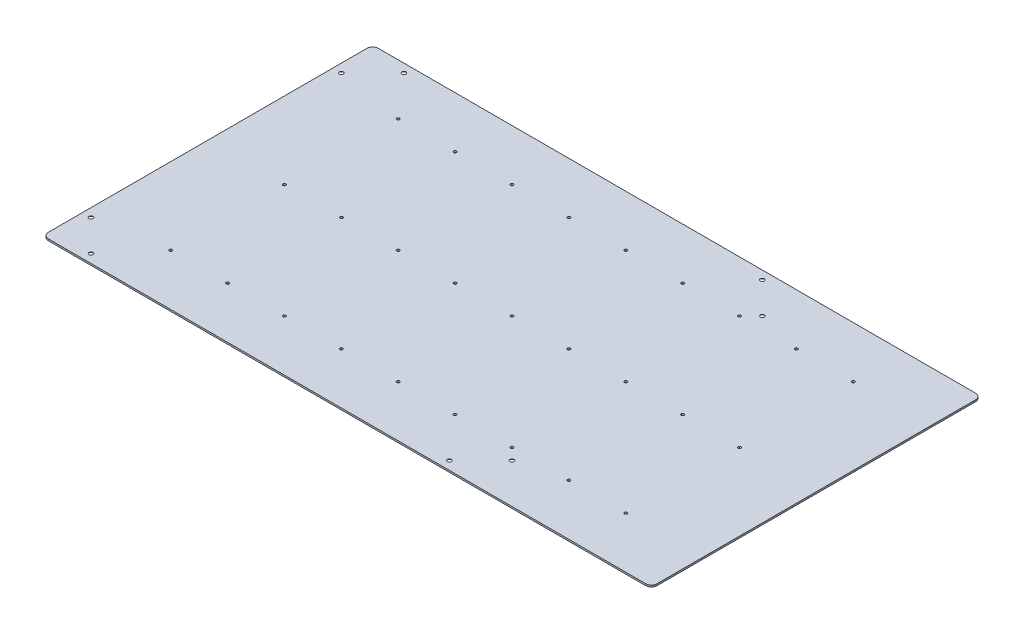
ISO-10303-21;
HEADER;
FILE_DESCRIPTION(('STEP AP214'),'2;1');
FILE_NAME('part.step','',(''),(''),'','','');
FILE_SCHEMA(('AUTOMOTIVE_DESIGN { 1 0 10303 214 1 1 1 1 }'));
ENDSEC;
DATA;
#1=APPLICATION_CONTEXT('core data for automotive mechanical design processes');
#2=APPLICATION_PROTOCOL_DEFINITION('international standard','automotive_design',2000,#1);
#3=PRODUCT_CONTEXT('',#1,'mechanical');
#4=PRODUCT('Part','Part','',(#3));
#5=PRODUCT_RELATED_PRODUCT_CATEGORY('part','',(#4));
#6=PRODUCT_DEFINITION_FORMATION('','',#4);
#7=PRODUCT_DEFINITION_CONTEXT('part definition',#1,'design');
#8=PRODUCT_DEFINITION('design','',#6,#7);
#9=PRODUCT_DEFINITION_SHAPE('','',#8);
#10=(LENGTH_UNIT() NAMED_UNIT(*) SI_UNIT(.MILLI.,.METRE.));
#11=(NAMED_UNIT(*) PLANE_ANGLE_UNIT() SI_UNIT($,.RADIAN.));
#12=(NAMED_UNIT(*) SI_UNIT($,.STERADIAN.) SOLID_ANGLE_UNIT());
#13=UNCERTAINTY_MEASURE_WITH_UNIT(LENGTH_MEASURE(1.E-05),#10,'distance_accuracy_value','');
#14=(GEOMETRIC_REPRESENTATION_CONTEXT(3) GLOBAL_UNCERTAINTY_ASSIGNED_CONTEXT((#13)) GLOBAL_UNIT_ASSIGNED_CONTEXT((#10,
#11,#12)) REPRESENTATION_CONTEXT('',''));
#15=CARTESIAN_POINT('',(0.,0.,0.));
#16=DIRECTION('',(0.,0.,1.));
#17=DIRECTION('',(1.,0.,0.));
#18=AXIS2_PLACEMENT_3D('',#15,#16,#17);
#19=CARTESIAN_POINT('',(400.,3.,-200.));
#20=DIRECTION('',(0.,1.,0.));
#21=DIRECTION('',(0.,0.,1.));
#22=AXIS2_PLACEMENT_3D('',#19,#20,#21);
#23=CYLINDRICAL_SURFACE('',#22,2.5);
#24=CARTESIAN_POINT('',(400.,0.,-200.));
#25=DIRECTION('',(0.,1.,0.));
#26=DIRECTION('',(0.,0.,1.));
#27=AXIS2_PLACEMENT_3D('',#24,#25,#26);
#28=CIRCLE('',#27,2.5);
#29=CARTESIAN_POINT('',(400.,0.,-197.5));
#30=VERTEX_POINT('',#29);
#31=EDGE_CURVE('E362',#30,#30,#28,.T.);
#32=ORIENTED_EDGE('',*,*,#31,.F.);
#33=EDGE_LOOP('',(#32));
#34=FACE_BOUND('',#33,.T.);
#35=CARTESIAN_POINT('',(400.,3.,-200.));
#36=DIRECTION('',(0.,1.,0.));
#37=DIRECTION('',(0.,0.,1.));
#38=AXIS2_PLACEMENT_3D('',#35,#36,#37);
#39=CIRCLE('',#38,2.5);
#40=CARTESIAN_POINT('',(400.,3.,-197.5));
#41=VERTEX_POINT('',#40);
#42=EDGE_CURVE('E366',#41,#41,#39,.T.);
#43=ORIENTED_EDGE('',*,*,#42,.T.);
#44=EDGE_LOOP('',(#43));
#45=FACE_BOUND('',#44,.T.);
#46=ADVANCED_FACE('F69',(#34,#45),#23,.F.);
#47=CARTESIAN_POINT('',(400.,3.,0.));
#48=DIRECTION('',(0.,1.,0.));
#49=DIRECTION('',(0.,0.,1.));
#50=AXIS2_PLACEMENT_3D('',#47,#48,#49);
#51=CYLINDRICAL_SURFACE('',#50,2.5);
#52=CARTESIAN_POINT('',(400.,0.,0.));
#53=DIRECTION('',(0.,1.,0.));
#54=DIRECTION('',(0.,0.,1.));
#55=AXIS2_PLACEMENT_3D('',#52,#53,#54);
#56=CIRCLE('',#55,2.5);
#57=CARTESIAN_POINT('',(400.,0.,2.49999999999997));
#58=VERTEX_POINT('',#57);
#59=EDGE_CURVE('E354',#58,#58,#56,.T.);
#60=ORIENTED_EDGE('',*,*,#59,.F.);
#61=EDGE_LOOP('',(#60));
#62=FACE_BOUND('',#61,.T.);
#63=CARTESIAN_POINT('',(400.,3.,0.));
#64=DIRECTION('',(0.,1.,0.));
#65=DIRECTION('',(0.,0.,1.));
#66=AXIS2_PLACEMENT_3D('',#63,#64,#65);
#67=CIRCLE('',#66,2.5);
#68=CARTESIAN_POINT('',(400.,3.,2.49999999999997));
#69=VERTEX_POINT('',#68);
#70=EDGE_CURVE('E358',#69,#69,#67,.T.);
#71=ORIENTED_EDGE('',*,*,#70,.T.);
#72=EDGE_LOOP('',(#71));
#73=FACE_BOUND('',#72,.T.);
#74=ADVANCED_FACE('F627',(#62,#73),#51,.F.);
#75=CARTESIAN_POINT('',(400.,3.,200.));
#76=DIRECTION('',(0.,1.,0.));
#77=DIRECTION('',(0.,0.,1.));
#78=AXIS2_PLACEMENT_3D('',#75,#76,#77);
#79=CYLINDRICAL_SURFACE('',#78,2.5);
#80=CARTESIAN_POINT('',(400.,0.,200.));
#81=DIRECTION('',(0.,1.,0.));
#82=DIRECTION('',(0.,0.,1.));
#83=AXIS2_PLACEMENT_3D('',#80,#81,#82);
#84=CIRCLE('',#83,2.5);
#85=CARTESIAN_POINT('',(400.,0.,202.5));
#86=VERTEX_POINT('',#85);
#87=EDGE_CURVE('E346',#86,#86,#84,.T.);
#88=ORIENTED_EDGE('',*,*,#87,.F.);
#89=EDGE_LOOP('',(#88));
#90=FACE_BOUND('',#89,.T.);
#91=CARTESIAN_POINT('',(400.,3.,200.));
#92=DIRECTION('',(0.,1.,0.));
#93=DIRECTION('',(0.,0.,1.));
#94=AXIS2_PLACEMENT_3D('',#91,#92,#93);
#95=CIRCLE('',#94,2.5);
#96=CARTESIAN_POINT('',(400.,3.,202.5));
#97=VERTEX_POINT('',#96);
#98=EDGE_CURVE('E350',#97,#97,#95,.T.);
#99=ORIENTED_EDGE('',*,*,#98,.T.);
#100=EDGE_LOOP('',(#99));
#101=FACE_BOUND('',#100,.T.);
#102=ADVANCED_FACE('F633',(#90,#101),#79,.F.);
#103=CARTESIAN_POINT('',(300.,3.,-200.));
#104=DIRECTION('',(0.,1.,0.));
#105=DIRECTION('',(0.,0.,1.));
#106=AXIS2_PLACEMENT_3D('',#103,#104,#105);
#107=CYLINDRICAL_SURFACE('',#106,2.5);
#108=CARTESIAN_POINT('',(300.,0.,-200.));
#109=DIRECTION('',(0.,1.,0.));
#110=DIRECTION('',(0.,0.,1.));
#111=AXIS2_PLACEMENT_3D('',#108,#109,#110);
#112=CIRCLE('',#111,2.5);
#113=CARTESIAN_POINT('',(300.,0.,-197.5));
#114=VERTEX_POINT('',#113);
#115=EDGE_CURVE('E338',#114,#114,#112,.T.);
#116=ORIENTED_EDGE('',*,*,#115,.F.);
#117=EDGE_LOOP('',(#116));
#118=FACE_BOUND('',#117,.T.);
#119=CARTESIAN_POINT('',(300.,3.,-200.));
#120=DIRECTION('',(0.,1.,0.));
#121=DIRECTION('',(0.,0.,1.));
#122=AXIS2_PLACEMENT_3D('',#119,#120,#121);
#123=CIRCLE('',#122,2.5);
#124=CARTESIAN_POINT('',(300.,3.,-197.5));
#125=VERTEX_POINT('',#124);
#126=EDGE_CURVE('E342',#125,#125,#123,.T.);
#127=ORIENTED_EDGE('',*,*,#126,.T.);
#128=EDGE_LOOP('',(#127));
#129=FACE_BOUND('',#128,.T.);
#130=ADVANCED_FACE('F747',(#118,#129),#107,.F.);
#131=CARTESIAN_POINT('',(300.,3.,200.));
#132=DIRECTION('',(0.,1.,0.));
#133=DIRECTION('',(0.,0.,1.));
#134=AXIS2_PLACEMENT_3D('',#131,#132,#133);
#135=CYLINDRICAL_SURFACE('',#134,2.5);
#136=CARTESIAN_POINT('',(300.,0.,200.));
#137=DIRECTION('',(0.,1.,0.));
#138=DIRECTION('',(0.,0.,1.));
#139=AXIS2_PLACEMENT_3D('',#136,#137,#138);
#140=CIRCLE('',#139,2.5);
#141=CARTESIAN_POINT('',(300.,0.,202.5));
#142=VERTEX_POINT('',#141);
#143=EDGE_CURVE('E330',#142,#142,#140,.T.);
#144=ORIENTED_EDGE('',*,*,#143,.F.);
#145=EDGE_LOOP('',(#144));
#146=FACE_BOUND('',#145,.T.);
#147=CARTESIAN_POINT('',(300.,3.,200.));
#148=DIRECTION('',(0.,1.,0.));
#149=DIRECTION('',(0.,0.,1.));
#150=AXIS2_PLACEMENT_3D('',#147,#148,#149);
#151=CIRCLE('',#150,2.5);
#152=CARTESIAN_POINT('',(300.,3.,202.5));
#153=VERTEX_POINT('',#152);
#154=EDGE_CURVE('E334',#153,#153,#151,.T.);
#155=ORIENTED_EDGE('',*,*,#154,.T.);
#156=EDGE_LOOP('',(#155));
#157=FACE_BOUND('',#156,.T.);
#158=ADVANCED_FACE('F743',(#146,#157),#135,.F.);
#159=CARTESIAN_POINT('',(200.,3.,-200.));
#160=DIRECTION('',(0.,1.,0.));
#161=DIRECTION('',(0.,0.,1.));
#162=AXIS2_PLACEMENT_3D('',#159,#160,#161);
#163=CYLINDRICAL_SURFACE('',#162,2.5);
#164=CARTESIAN_POINT('',(200.,0.,-200.));
#165=DIRECTION('',(0.,1.,0.));
#166=DIRECTION('',(0.,0.,1.));
#167=AXIS2_PLACEMENT_3D('',#164,#165,#166);
#168=CIRCLE('',#167,2.5);
#169=CARTESIAN_POINT('',(200.,0.,-197.5));
#170=VERTEX_POINT('',#169);
#171=EDGE_CURVE('E322',#170,#170,#168,.T.);
#172=ORIENTED_EDGE('',*,*,#171,.F.);
#173=EDGE_LOOP('',(#172));
#174=FACE_BOUND('',#173,.T.);
#175=CARTESIAN_POINT('',(200.,3.,-200.));
#176=DIRECTION('',(0.,1.,0.));
#177=DIRECTION('',(0.,0.,1.));
#178=AXIS2_PLACEMENT_3D('',#175,#176,#177);
#179=CIRCLE('',#178,2.5);
#180=CARTESIAN_POINT('',(200.,3.,-197.5));
#181=VERTEX_POINT('',#180);
#182=EDGE_CURVE('E326',#181,#181,#179,.T.);
#183=ORIENTED_EDGE('',*,*,#182,.T.);
#184=EDGE_LOOP('',(#183));
#185=FACE_BOUND('',#184,.T.);
#186=ADVANCED_FACE('F739',(#174,#185),#163,.F.);
#187=CARTESIAN_POINT('',(200.,3.,200.));
#188=DIRECTION('',(0.,1.,0.));
#189=DIRECTION('',(0.,0.,1.));
#190=AXIS2_PLACEMENT_3D('',#187,#188,#189);
#191=CYLINDRICAL_SURFACE('',#190,2.5);
#192=CARTESIAN_POINT('',(200.,0.,200.));
#193=DIRECTION('',(0.,1.,0.));
#194=DIRECTION('',(0.,0.,1.));
#195=AXIS2_PLACEMENT_3D('',#192,#193,#194);
#196=CIRCLE('',#195,2.5);
#197=CARTESIAN_POINT('',(200.,0.,202.5));
#198=VERTEX_POINT('',#197);
#199=EDGE_CURVE('E314',#198,#198,#196,.T.);
#200=ORIENTED_EDGE('',*,*,#199,.F.);
#201=EDGE_LOOP('',(#200));
#202=FACE_BOUND('',#201,.T.);
#203=CARTESIAN_POINT('',(200.,3.,200.));
#204=DIRECTION('',(0.,1.,0.));
#205=DIRECTION('',(0.,0.,1.));
#206=AXIS2_PLACEMENT_3D('',#203,#204,#205);
#207=CIRCLE('',#206,2.5);
#208=CARTESIAN_POINT('',(200.,3.,202.5));
#209=VERTEX_POINT('',#208);
#210=EDGE_CURVE('E318',#209,#209,#207,.T.);
#211=ORIENTED_EDGE('',*,*,#210,.T.);
#212=EDGE_LOOP('',(#211));
#213=FACE_BOUND('',#212,.T.);
#214=ADVANCED_FACE('F735',(#202,#213),#191,.F.);
#215=CARTESIAN_POINT('',(100.,3.,-200.));
#216=DIRECTION('',(0.,1.,0.));
#217=DIRECTION('',(0.,0.,1.));
#218=AXIS2_PLACEMENT_3D('',#215,#216,#217);
#219=CYLINDRICAL_SURFACE('',#218,2.5);
#220=CARTESIAN_POINT('',(100.,0.,-200.));
#221=DIRECTION('',(0.,1.,0.));
#222=DIRECTION('',(0.,0.,1.));
#223=AXIS2_PLACEMENT_3D('',#220,#221,#222);
#224=CIRCLE('',#223,2.5);
#225=CARTESIAN_POINT('',(100.,0.,-197.5));
#226=VERTEX_POINT('',#225);
#227=EDGE_CURVE('E306',#226,#226,#224,.T.);
#228=ORIENTED_EDGE('',*,*,#227,.F.);
#229=EDGE_LOOP('',(#228));
#230=FACE_BOUND('',#229,.T.);
#231=CARTESIAN_POINT('',(100.,3.,-200.));
#232=DIRECTION('',(0.,1.,0.));
#233=DIRECTION('',(0.,0.,1.));
#234=AXIS2_PLACEMENT_3D('',#231,#232,#233);
#235=CIRCLE('',#234,2.5);
#236=CARTESIAN_POINT('',(100.,3.,-197.5));
#237=VERTEX_POINT('',#236);
#238=EDGE_CURVE('E310',#237,#237,#235,.T.);
#239=ORIENTED_EDGE('',*,*,#238,.T.);
#240=EDGE_LOOP('',(#239));
#241=FACE_BOUND('',#240,.T.);
#242=ADVANCED_FACE('F731',(#230,#241),#219,.F.);
#243=CARTESIAN_POINT('',(100.,3.,200.));
#244=DIRECTION('',(0.,1.,0.));
#245=DIRECTION('',(0.,0.,1.));
#246=AXIS2_PLACEMENT_3D('',#243,#244,#245);
#247=CYLINDRICAL_SURFACE('',#246,2.5);
#248=CARTESIAN_POINT('',(100.,0.,200.));
#249=DIRECTION('',(0.,1.,0.));
#250=DIRECTION('',(0.,0.,1.));
#251=AXIS2_PLACEMENT_3D('',#248,#249,#250);
#252=CIRCLE('',#251,2.5);
#253=CARTESIAN_POINT('',(100.,0.,202.5));
#254=VERTEX_POINT('',#253);
#255=EDGE_CURVE('E298',#254,#254,#252,.T.);
#256=ORIENTED_EDGE('',*,*,#255,.F.);
#257=EDGE_LOOP('',(#256));
#258=FACE_BOUND('',#257,.T.);
#259=CARTESIAN_POINT('',(100.,3.,200.));
#260=DIRECTION('',(0.,1.,0.));
#261=DIRECTION('',(0.,0.,1.));
#262=AXIS2_PLACEMENT_3D('',#259,#260,#261);
#263=CIRCLE('',#262,2.5);
#264=CARTESIAN_POINT('',(100.,3.,202.5));
#265=VERTEX_POINT('',#264);
#266=EDGE_CURVE('E302',#265,#265,#263,.T.);
#267=ORIENTED_EDGE('',*,*,#266,.T.);
#268=EDGE_LOOP('',(#267));
#269=FACE_BOUND('',#268,.T.);
#270=ADVANCED_FACE('F727',(#258,#269),#247,.F.);
#271=CARTESIAN_POINT('',(0.,3.,-200.));
#272=DIRECTION('',(0.,1.,0.));
#273=DIRECTION('',(0.,0.,1.));
#274=AXIS2_PLACEMENT_3D('',#271,#272,#273);
#275=CYLINDRICAL_SURFACE('',#274,2.5);
#276=CARTESIAN_POINT('',(0.,0.,-200.));
#277=DIRECTION('',(0.,1.,0.));
#278=DIRECTION('',(0.,0.,1.));
#279=AXIS2_PLACEMENT_3D('',#276,#277,#278);
#280=CIRCLE('',#279,2.5);
#281=CARTESIAN_POINT('',(0.,0.,-197.5));
#282=VERTEX_POINT('',#281);
#283=EDGE_CURVE('E290',#282,#282,#280,.T.);
#284=ORIENTED_EDGE('',*,*,#283,.F.);
#285=EDGE_LOOP('',(#284));
#286=FACE_BOUND('',#285,.T.);
#287=CARTESIAN_POINT('',(0.,3.,-200.));
#288=DIRECTION('',(0.,1.,0.));
#289=DIRECTION('',(0.,0.,1.));
#290=AXIS2_PLACEMENT_3D('',#287,#288,#289);
#291=CIRCLE('',#290,2.5);
#292=CARTESIAN_POINT('',(0.,3.,-197.5));
#293=VERTEX_POINT('',#292);
#294=EDGE_CURVE('E294',#293,#293,#291,.T.);
#295=ORIENTED_EDGE('',*,*,#294,.T.);
#296=EDGE_LOOP('',(#295));
#297=FACE_BOUND('',#296,.T.);
#298=ADVANCED_FACE('F723',(#286,#297),#275,.F.);
#299=CARTESIAN_POINT('',(1.11022302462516E-13,3.,200.));
#300=DIRECTION('',(0.,1.,0.));
#301=DIRECTION('',(0.,0.,1.));
#302=AXIS2_PLACEMENT_3D('',#299,#300,#301);
#303=CYLINDRICAL_SURFACE('',#302,2.5);
#304=CARTESIAN_POINT('',(1.11022302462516E-13,0.,200.));
#305=DIRECTION('',(0.,1.,0.));
#306=DIRECTION('',(0.,0.,1.));
#307=AXIS2_PLACEMENT_3D('',#304,#305,#306);
#308=CIRCLE('',#307,2.5);
#309=CARTESIAN_POINT('',(1.11022302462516E-13,0.,202.5));
#310=VERTEX_POINT('',#309);
#311=EDGE_CURVE('E282',#310,#310,#308,.T.);
#312=ORIENTED_EDGE('',*,*,#311,.F.);
#313=EDGE_LOOP('',(#312));
#314=FACE_BOUND('',#313,.T.);
#315=CARTESIAN_POINT('',(1.11022302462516E-13,3.,200.));
#316=DIRECTION('',(0.,1.,0.));
#317=DIRECTION('',(0.,0.,1.));
#318=AXIS2_PLACEMENT_3D('',#315,#316,#317);
#319=CIRCLE('',#318,2.5);
#320=CARTESIAN_POINT('',(1.11022302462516E-13,3.,202.5));
#321=VERTEX_POINT('',#320);
#322=EDGE_CURVE('E286',#321,#321,#319,.T.);
#323=ORIENTED_EDGE('',*,*,#322,.T.);
#324=EDGE_LOOP('',(#323));
#325=FACE_BOUND('',#324,.T.);
#326=ADVANCED_FACE('F719',(#314,#325),#303,.F.);
#327=CARTESIAN_POINT('',(-99.9999999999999,3.,-200.));
#328=DIRECTION('',(0.,1.,0.));
#329=DIRECTION('',(0.,0.,1.));
#330=AXIS2_PLACEMENT_3D('',#327,#328,#329);
#331=CYLINDRICAL_SURFACE('',#330,2.5);
#332=CARTESIAN_POINT('',(-99.9999999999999,0.,-200.));
#333=DIRECTION('',(0.,1.,0.));
#334=DIRECTION('',(0.,0.,1.));
#335=AXIS2_PLACEMENT_3D('',#332,#333,#334);
#336=CIRCLE('',#335,2.5);
#337=CARTESIAN_POINT('',(-99.9999999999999,0.,-197.5));
#338=VERTEX_POINT('',#337);
#339=EDGE_CURVE('E274',#338,#338,#336,.T.);
#340=ORIENTED_EDGE('',*,*,#339,.F.);
#341=EDGE_LOOP('',(#340));
#342=FACE_BOUND('',#341,.T.);
#343=CARTESIAN_POINT('',(-99.9999999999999,3.,-200.));
#344=DIRECTION('',(0.,1.,0.));
#345=DIRECTION('',(0.,0.,1.));
#346=AXIS2_PLACEMENT_3D('',#343,#344,#345);
#347=CIRCLE('',#346,2.5);
#348=CARTESIAN_POINT('',(-99.9999999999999,3.,-197.5));
#349=VERTEX_POINT('',#348);
#350=EDGE_CURVE('E278',#349,#349,#347,.T.);
#351=ORIENTED_EDGE('',*,*,#350,.T.);
#352=EDGE_LOOP('',(#351));
#353=FACE_BOUND('',#352,.T.);
#354=ADVANCED_FACE('F715',(#342,#353),#331,.F.);
#355=CARTESIAN_POINT('',(-99.9999999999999,3.,200.));
#356=DIRECTION('',(0.,1.,0.));
#357=DIRECTION('',(0.,0.,1.));
#358=AXIS2_PLACEMENT_3D('',#355,#356,#357);
#359=CYLINDRICAL_SURFACE('',#358,2.5);
#360=CARTESIAN_POINT('',(-99.9999999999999,0.,200.));
#361=DIRECTION('',(0.,1.,0.));
#362=DIRECTION('',(0.,0.,1.));
#363=AXIS2_PLACEMENT_3D('',#360,#361,#362);
#364=CIRCLE('',#363,2.5);
#365=CARTESIAN_POINT('',(-99.9999999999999,0.,202.5));
#366=VERTEX_POINT('',#365);
#367=EDGE_CURVE('E266',#366,#366,#364,.T.);
#368=ORIENTED_EDGE('',*,*,#367,.F.);
#369=EDGE_LOOP('',(#368));
#370=FACE_BOUND('',#369,.T.);
#371=CARTESIAN_POINT('',(-99.9999999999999,3.,200.));
#372=DIRECTION('',(0.,1.,0.));
#373=DIRECTION('',(0.,0.,1.));
#374=AXIS2_PLACEMENT_3D('',#371,#372,#373);
#375=CIRCLE('',#374,2.5);
#376=CARTESIAN_POINT('',(-99.9999999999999,3.,202.5));
#377=VERTEX_POINT('',#376);
#378=EDGE_CURVE('E270',#377,#377,#375,.T.);
#379=ORIENTED_EDGE('',*,*,#378,.T.);
#380=EDGE_LOOP('',(#379));
#381=FACE_BOUND('',#380,.T.);
#382=ADVANCED_FACE('F711',(#370,#381),#359,.F.);
#383=CARTESIAN_POINT('',(-200.,3.,-200.));
#384=DIRECTION('',(0.,1.,0.));
#385=DIRECTION('',(0.,0.,1.));
#386=AXIS2_PLACEMENT_3D('',#383,#384,#385);
#387=CYLINDRICAL_SURFACE('',#386,2.5);
#388=CARTESIAN_POINT('',(-200.,0.,-200.));
#389=DIRECTION('',(0.,1.,0.));
#390=DIRECTION('',(0.,0.,1.));
#391=AXIS2_PLACEMENT_3D('',#388,#389,#390);
#392=CIRCLE('',#391,2.5);
#393=CARTESIAN_POINT('',(-200.,0.,-197.5));
#394=VERTEX_POINT('',#393);
#395=EDGE_CURVE('E258',#394,#394,#392,.T.);
#396=ORIENTED_EDGE('',*,*,#395,.F.);
#397=EDGE_LOOP('',(#396));
#398=FACE_BOUND('',#397,.T.);
#399=CARTESIAN_POINT('',(-200.,3.,-200.));
#400=DIRECTION('',(0.,1.,0.));
#401=DIRECTION('',(0.,0.,1.));
#402=AXIS2_PLACEMENT_3D('',#399,#400,#401);
#403=CIRCLE('',#402,2.5);
#404=CARTESIAN_POINT('',(-200.,3.,-197.5));
#405=VERTEX_POINT('',#404);
#406=EDGE_CURVE('E262',#405,#405,#403,.T.);
#407=ORIENTED_EDGE('',*,*,#406,.T.);
#408=EDGE_LOOP('',(#407));
#409=FACE_BOUND('',#408,.T.);
#410=ADVANCED_FACE('F707',(#398,#409),#387,.F.);
#411=CARTESIAN_POINT('',(-200.,3.,200.));
#412=DIRECTION('',(0.,1.,0.));
#413=DIRECTION('',(0.,0.,1.));
#414=AXIS2_PLACEMENT_3D('',#411,#412,#413);
#415=CYLINDRICAL_SURFACE('',#414,2.5);
#416=CARTESIAN_POINT('',(-200.,0.,200.));
#417=DIRECTION('',(0.,1.,0.));
#418=DIRECTION('',(0.,0.,1.));
#419=AXIS2_PLACEMENT_3D('',#416,#417,#418);
#420=CIRCLE('',#419,2.5);
#421=CARTESIAN_POINT('',(-200.,0.,202.5));
#422=VERTEX_POINT('',#421);
#423=EDGE_CURVE('E250',#422,#422,#420,.T.);
#424=ORIENTED_EDGE('',*,*,#423,.F.);
#425=EDGE_LOOP('',(#424));
#426=FACE_BOUND('',#425,.T.);
#427=CARTESIAN_POINT('',(-200.,3.,200.));
#428=DIRECTION('',(0.,1.,0.));
#429=DIRECTION('',(0.,0.,1.));
#430=AXIS2_PLACEMENT_3D('',#427,#428,#429);
#431=CIRCLE('',#430,2.5);
#432=CARTESIAN_POINT('',(-200.,3.,202.5));
#433=VERTEX_POINT('',#432);
#434=EDGE_CURVE('E254',#433,#433,#431,.T.);
#435=ORIENTED_EDGE('',*,*,#434,.T.);
#436=EDGE_LOOP('',(#435));
#437=FACE_BOUND('',#436,.T.);
#438=ADVANCED_FACE('F703',(#426,#437),#415,.F.);
#439=CARTESIAN_POINT('',(-300.,3.,-200.));
#440=DIRECTION('',(0.,1.,0.));
#441=DIRECTION('',(0.,0.,1.));
#442=AXIS2_PLACEMENT_3D('',#439,#440,#441);
#443=CYLINDRICAL_SURFACE('',#442,2.5);
#444=CARTESIAN_POINT('',(-300.,0.,-200.));
#445=DIRECTION('',(0.,1.,0.));
#446=DIRECTION('',(0.,0.,1.));
#447=AXIS2_PLACEMENT_3D('',#444,#445,#446);
#448=CIRCLE('',#447,2.5);
#449=CARTESIAN_POINT('',(-300.,0.,-197.5));
#450=VERTEX_POINT('',#449);
#451=EDGE_CURVE('E242',#450,#450,#448,.T.);
#452=ORIENTED_EDGE('',*,*,#451,.F.);
#453=EDGE_LOOP('',(#452));
#454=FACE_BOUND('',#453,.T.);
#455=CARTESIAN_POINT('',(-300.,3.,-200.));
#456=DIRECTION('',(0.,1.,0.));
#457=DIRECTION('',(0.,0.,1.));
#458=AXIS2_PLACEMENT_3D('',#455,#456,#457);
#459=CIRCLE('',#458,2.5);
#460=CARTESIAN_POINT('',(-300.,3.,-197.5));
#461=VERTEX_POINT('',#460);
#462=EDGE_CURVE('E246',#461,#461,#459,.T.);
#463=ORIENTED_EDGE('',*,*,#462,.T.);
#464=EDGE_LOOP('',(#463));
#465=FACE_BOUND('',#464,.T.);
#466=ADVANCED_FACE('F699',(#454,#465),#443,.F.);
#467=CARTESIAN_POINT('',(-300.,3.,200.));
#468=DIRECTION('',(0.,1.,0.));
#469=DIRECTION('',(0.,0.,1.));
#470=AXIS2_PLACEMENT_3D('',#467,#468,#469);
#471=CYLINDRICAL_SURFACE('',#470,2.5);
#472=CARTESIAN_POINT('',(-300.,0.,200.));
#473=DIRECTION('',(0.,1.,0.));
#474=DIRECTION('',(0.,0.,1.));
#475=AXIS2_PLACEMENT_3D('',#472,#473,#474);
#476=CIRCLE('',#475,2.5);
#477=CARTESIAN_POINT('',(-300.,0.,202.5));
#478=VERTEX_POINT('',#477);
#479=EDGE_CURVE('E234',#478,#478,#476,.T.);
#480=ORIENTED_EDGE('',*,*,#479,.F.);
#481=EDGE_LOOP('',(#480));
#482=FACE_BOUND('',#481,.T.);
#483=CARTESIAN_POINT('',(-300.,3.,200.));
#484=DIRECTION('',(0.,1.,0.));
#485=DIRECTION('',(0.,0.,1.));
#486=AXIS2_PLACEMENT_3D('',#483,#484,#485);
#487=CIRCLE('',#486,2.5);
#488=CARTESIAN_POINT('',(-300.,3.,202.5));
#489=VERTEX_POINT('',#488);
#490=EDGE_CURVE('E238',#489,#489,#487,.T.);
#491=ORIENTED_EDGE('',*,*,#490,.T.);
#492=EDGE_LOOP('',(#491));
#493=FACE_BOUND('',#492,.T.);
#494=ADVANCED_FACE('F695',(#482,#493),#471,.F.);
#495=CARTESIAN_POINT('',(-400.,3.,-200.));
#496=DIRECTION('',(0.,1.,0.));
#497=DIRECTION('',(0.,0.,1.));
#498=AXIS2_PLACEMENT_3D('',#495,#496,#497);
#499=CYLINDRICAL_SURFACE('',#498,2.5);
#500=CARTESIAN_POINT('',(-400.,0.,-200.));
#501=DIRECTION('',(0.,1.,0.));
#502=DIRECTION('',(0.,0.,1.));
#503=AXIS2_PLACEMENT_3D('',#500,#501,#502);
#504=CIRCLE('',#503,2.5);
#505=CARTESIAN_POINT('',(-400.,0.,-197.5));
#506=VERTEX_POINT('',#505);
#507=EDGE_CURVE('E226',#506,#506,#504,.T.);
#508=ORIENTED_EDGE('',*,*,#507,.F.);
#509=EDGE_LOOP('',(#508));
#510=FACE_BOUND('',#509,.T.);
#511=CARTESIAN_POINT('',(-400.,3.,-200.));
#512=DIRECTION('',(0.,1.,0.));
#513=DIRECTION('',(0.,0.,1.));
#514=AXIS2_PLACEMENT_3D('',#511,#512,#513);
#515=CIRCLE('',#514,2.5);
#516=CARTESIAN_POINT('',(-400.,3.,-197.5));
#517=VERTEX_POINT('',#516);
#518=EDGE_CURVE('E230',#517,#517,#515,.T.);
#519=ORIENTED_EDGE('',*,*,#518,.T.);
#520=EDGE_LOOP('',(#519));
#521=FACE_BOUND('',#520,.T.);
#522=ADVANCED_FACE('F691',(#510,#521),#499,.F.);
#523=CARTESIAN_POINT('',(300.,3.,0.));
#524=DIRECTION('',(0.,1.,0.));
#525=DIRECTION('',(0.,0.,1.));
#526=AXIS2_PLACEMENT_3D('',#523,#524,#525);
#527=CYLINDRICAL_SURFACE('',#526,2.5);
#528=CARTESIAN_POINT('',(300.,0.,0.));
#529=DIRECTION('',(0.,1.,0.));
#530=DIRECTION('',(0.,0.,1.));
#531=AXIS2_PLACEMENT_3D('',#528,#529,#530);
#532=CIRCLE('',#531,2.5);
#533=CARTESIAN_POINT('',(300.,0.,2.49999999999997));
#534=VERTEX_POINT('',#533);
#535=EDGE_CURVE('E218',#534,#534,#532,.T.);
#536=ORIENTED_EDGE('',*,*,#535,.F.);
#537=EDGE_LOOP('',(#536));
#538=FACE_BOUND('',#537,.T.);
#539=CARTESIAN_POINT('',(300.,3.,0.));
#540=DIRECTION('',(0.,1.,0.));
#541=DIRECTION('',(0.,0.,1.));
#542=AXIS2_PLACEMENT_3D('',#539,#540,#541);
#543=CIRCLE('',#542,2.5);
#544=CARTESIAN_POINT('',(300.,3.,2.49999999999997));
#545=VERTEX_POINT('',#544);
#546=EDGE_CURVE('E222',#545,#545,#543,.T.);
#547=ORIENTED_EDGE('',*,*,#546,.T.);
#548=EDGE_LOOP('',(#547));
#549=FACE_BOUND('',#548,.T.);
#550=ADVANCED_FACE('F687',(#538,#549),#527,.F.);
#551=CARTESIAN_POINT('',(200.,3.,0.));
#552=DIRECTION('',(0.,1.,0.));
#553=DIRECTION('',(0.,0.,1.));
#554=AXIS2_PLACEMENT_3D('',#551,#552,#553);
#555=CYLINDRICAL_SURFACE('',#554,2.5);
#556=CARTESIAN_POINT('',(200.,0.,0.));
#557=DIRECTION('',(0.,1.,0.));
#558=DIRECTION('',(0.,0.,1.));
#559=AXIS2_PLACEMENT_3D('',#556,#557,#558);
#560=CIRCLE('',#559,2.5);
#561=CARTESIAN_POINT('',(200.,0.,2.49999999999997));
#562=VERTEX_POINT('',#561);
#563=EDGE_CURVE('E210',#562,#562,#560,.T.);
#564=ORIENTED_EDGE('',*,*,#563,.F.);
#565=EDGE_LOOP('',(#564));
#566=FACE_BOUND('',#565,.T.);
#567=CARTESIAN_POINT('',(200.,3.,0.));
#568=DIRECTION('',(0.,1.,0.));
#569=DIRECTION('',(0.,0.,1.));
#570=AXIS2_PLACEMENT_3D('',#567,#568,#569);
#571=CIRCLE('',#570,2.5);
#572=CARTESIAN_POINT('',(200.,3.,2.49999999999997));
#573=VERTEX_POINT('',#572);
#574=EDGE_CURVE('E214',#573,#573,#571,.T.);
#575=ORIENTED_EDGE('',*,*,#574,.T.);
#576=EDGE_LOOP('',(#575));
#577=FACE_BOUND('',#576,.T.);
#578=ADVANCED_FACE('F683',(#566,#577),#555,.F.);
#579=CARTESIAN_POINT('',(100.,3.,0.));
#580=DIRECTION('',(0.,1.,0.));
#581=DIRECTION('',(0.,0.,1.));
#582=AXIS2_PLACEMENT_3D('',#579,#580,#581);
#583=CYLINDRICAL_SURFACE('',#582,2.5);
#584=CARTESIAN_POINT('',(100.,0.,0.));
#585=DIRECTION('',(0.,1.,0.));
#586=DIRECTION('',(0.,0.,1.));
#587=AXIS2_PLACEMENT_3D('',#584,#585,#586);
#588=CIRCLE('',#587,2.5);
#589=CARTESIAN_POINT('',(100.,0.,2.49999999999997));
#590=VERTEX_POINT('',#589);
#591=EDGE_CURVE('E202',#590,#590,#588,.T.);
#592=ORIENTED_EDGE('',*,*,#591,.F.);
#593=EDGE_LOOP('',(#592));
#594=FACE_BOUND('',#593,.T.);
#595=CARTESIAN_POINT('',(100.,3.,0.));
#596=DIRECTION('',(0.,1.,0.));
#597=DIRECTION('',(0.,0.,1.));
#598=AXIS2_PLACEMENT_3D('',#595,#596,#597);
#599=CIRCLE('',#598,2.5);
#600=CARTESIAN_POINT('',(100.,3.,2.49999999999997));
#601=VERTEX_POINT('',#600);
#602=EDGE_CURVE('E206',#601,#601,#599,.T.);
#603=ORIENTED_EDGE('',*,*,#602,.T.);
#604=EDGE_LOOP('',(#603));
#605=FACE_BOUND('',#604,.T.);
#606=ADVANCED_FACE('F679',(#594,#605),#583,.F.);
#607=CARTESIAN_POINT('',(0.,3.,0.));
#608=DIRECTION('',(0.,1.,0.));
#609=DIRECTION('',(0.,0.,1.));
#610=AXIS2_PLACEMENT_3D('',#607,#608,#609);
#611=CYLINDRICAL_SURFACE('',#610,2.5);
#612=CARTESIAN_POINT('',(0.,0.,0.));
#613=DIRECTION('',(0.,1.,0.));
#614=DIRECTION('',(0.,0.,1.));
#615=AXIS2_PLACEMENT_3D('',#612,#613,#614);
#616=CIRCLE('',#615,2.5);
#617=CARTESIAN_POINT('',(0.,0.,2.49999999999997));
#618=VERTEX_POINT('',#617);
#619=EDGE_CURVE('E194',#618,#618,#616,.T.);
#620=ORIENTED_EDGE('',*,*,#619,.F.);
#621=EDGE_LOOP('',(#620));
#622=FACE_BOUND('',#621,.T.);
#623=CARTESIAN_POINT('',(0.,3.,0.));
#624=DIRECTION('',(0.,1.,0.));
#625=DIRECTION('',(0.,0.,1.));
#626=AXIS2_PLACEMENT_3D('',#623,#624,#625);
#627=CIRCLE('',#626,2.5);
#628=CARTESIAN_POINT('',(0.,3.,2.49999999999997));
#629=VERTEX_POINT('',#628);
#630=EDGE_CURVE('E198',#629,#629,#627,.T.);
#631=ORIENTED_EDGE('',*,*,#630,.T.);
#632=EDGE_LOOP('',(#631));
#633=FACE_BOUND('',#632,.T.);
#634=ADVANCED_FACE('F675',(#622,#633),#611,.F.);
#635=CARTESIAN_POINT('',(-99.9999999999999,3.,0.));
#636=DIRECTION('',(0.,1.,0.));
#637=DIRECTION('',(0.,0.,1.));
#638=AXIS2_PLACEMENT_3D('',#635,#636,#637);
#639=CYLINDRICAL_SURFACE('',#638,2.5);
#640=CARTESIAN_POINT('',(-99.9999999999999,0.,0.));
#641=DIRECTION('',(0.,1.,0.));
#642=DIRECTION('',(0.,0.,1.));
#643=AXIS2_PLACEMENT_3D('',#640,#641,#642);
#644=CIRCLE('',#643,2.5);
#645=CARTESIAN_POINT('',(-99.9999999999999,0.,2.49999999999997));
#646=VERTEX_POINT('',#645);
#647=EDGE_CURVE('E186',#646,#646,#644,.T.);
#648=ORIENTED_EDGE('',*,*,#647,.F.);
#649=EDGE_LOOP('',(#648));
#650=FACE_BOUND('',#649,.T.);
#651=CARTESIAN_POINT('',(-99.9999999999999,3.,0.));
#652=DIRECTION('',(0.,1.,0.));
#653=DIRECTION('',(0.,0.,1.));
#654=AXIS2_PLACEMENT_3D('',#651,#652,#653);
#655=CIRCLE('',#654,2.5);
#656=CARTESIAN_POINT('',(-99.9999999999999,3.,2.49999999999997));
#657=VERTEX_POINT('',#656);
#658=EDGE_CURVE('E190',#657,#657,#655,.T.);
#659=ORIENTED_EDGE('',*,*,#658,.T.);
#660=EDGE_LOOP('',(#659));
#661=FACE_BOUND('',#660,.T.);
#662=ADVANCED_FACE('F671',(#650,#661),#639,.F.);
#663=CARTESIAN_POINT('',(-200.,3.,0.));
#664=DIRECTION('',(0.,1.,0.));
#665=DIRECTION('',(0.,0.,1.));
#666=AXIS2_PLACEMENT_3D('',#663,#664,#665);
#667=CYLINDRICAL_SURFACE('',#666,2.5);
#668=CARTESIAN_POINT('',(-200.,0.,0.));
#669=DIRECTION('',(0.,1.,0.));
#670=DIRECTION('',(0.,0.,1.));
#671=AXIS2_PLACEMENT_3D('',#668,#669,#670);
#672=CIRCLE('',#671,2.5);
#673=CARTESIAN_POINT('',(-200.,0.,2.49999999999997));
#674=VERTEX_POINT('',#673);
#675=EDGE_CURVE('E177',#674,#674,#672,.T.);
#676=ORIENTED_EDGE('',*,*,#675,.F.);
#677=EDGE_LOOP('',(#676));
#678=FACE_BOUND('',#677,.T.);
#679=CARTESIAN_POINT('',(-200.,3.,0.));
#680=DIRECTION('',(0.,1.,0.));
#681=DIRECTION('',(0.,0.,1.));
#682=AXIS2_PLACEMENT_3D('',#679,#680,#681);
#683=CIRCLE('',#682,2.5);
#684=CARTESIAN_POINT('',(-200.,3.,2.49999999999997));
#685=VERTEX_POINT('',#684);
#686=EDGE_CURVE('E181',#685,#685,#683,.T.);
#687=ORIENTED_EDGE('',*,*,#686,.T.);
#688=EDGE_LOOP('',(#687));
#689=FACE_BOUND('',#688,.T.);
#690=ADVANCED_FACE('F665',(#678,#689),#667,.F.);
#691=CARTESIAN_POINT('',(535.,3.,-290.));
#692=DIRECTION('',(-1.,0.,0.));
#693=DIRECTION('',(0.,0.,1.));
#694=AXIS2_PLACEMENT_3D('',#691,#692,#693);
#695=PLANE('',#694);
#696=DIRECTION('',(0.,0.,-1.));
#697=VECTOR('',#696,1.);
#698=CARTESIAN_POINT('',(535.,0.,-290.));
#699=LINE('',#698,#697);
#700=CARTESIAN_POINT('',(535.,0.,280.));
#701=VERTEX_POINT('',#700);
#702=CARTESIAN_POINT('',(535.,0.,-280.));
#703=VERTEX_POINT('',#702);
#704=EDGE_CURVE('E173',#701,#703,#699,.T.);
#705=ORIENTED_EDGE('',*,*,#704,.T.);
#706=DIRECTION('',(0.,-1.,0.));
#707=VECTOR('',#706,1.);
#708=CARTESIAN_POINT('',(535.,3.,-280.));
#709=LINE('',#708,#707);
#710=CARTESIAN_POINT('',(535.,3.,-280.));
#711=VERTEX_POINT('',#710);
#712=EDGE_CURVE('E398',#703,#711,#709,.F.);
#713=ORIENTED_EDGE('',*,*,#712,.T.);
#714=DIRECTION('',(0.,0.,-1.));
#715=VECTOR('',#714,1.);
#716=CARTESIAN_POINT('',(535.,3.,-290.));
#717=LINE('',#716,#715);
#718=CARTESIAN_POINT('',(535.,3.,280.));
#719=VERTEX_POINT('',#718);
#720=EDGE_CURVE('E171',#719,#711,#717,.T.);
#721=ORIENTED_EDGE('',*,*,#720,.F.);
#722=DIRECTION('',(0.,-1.,0.));
#723=VECTOR('',#722,1.);
#724=CARTESIAN_POINT('',(535.,3.,280.));
#725=LINE('',#724,#723);
#726=EDGE_CURVE('E394',#719,#701,#725,.T.);
#727=ORIENTED_EDGE('',*,*,#726,.T.);
#728=EDGE_LOOP('',(#705,#713,#721,#727));
#729=FACE_BOUND('',#728,.T.);
#730=ADVANCED_FACE('F654',(#729),#695,.F.);
#731=CARTESIAN_POINT('',(-535.,3.,-290.));
#732=DIRECTION('',(0.,0.,1.));
#733=DIRECTION('',(1.,0.,0.));
#734=AXIS2_PLACEMENT_3D('',#731,#732,#733);
#735=PLANE('',#734);
#736=DIRECTION('',(-1.,0.,0.));
#737=VECTOR('',#736,1.);
#738=CARTESIAN_POINT('',(-535.,0.,-290.));
#739=LINE('',#738,#737);
#740=CARTESIAN_POINT('',(525.,0.,-290.));
#741=VERTEX_POINT('',#740);
#742=CARTESIAN_POINT('',(-525.,0.,-290.));
#743=VERTEX_POINT('',#742);
#744=EDGE_CURVE('E167',#741,#743,#739,.T.);
#745=ORIENTED_EDGE('',*,*,#744,.T.);
#746=DIRECTION('',(0.,-1.,0.));
#747=VECTOR('',#746,1.);
#748=CARTESIAN_POINT('',(-525.,3.,-290.));
#749=LINE('',#748,#747);
#750=CARTESIAN_POINT('',(-525.,3.,-290.));
#751=VERTEX_POINT('',#750);
#752=EDGE_CURVE('E141',#743,#751,#749,.F.);
#753=ORIENTED_EDGE('',*,*,#752,.T.);
#754=DIRECTION('',(-1.,0.,0.));
#755=VECTOR('',#754,1.);
#756=CARTESIAN_POINT('',(-535.,3.,-290.));
#757=LINE('',#756,#755);
#758=CARTESIAN_POINT('',(525.,3.,-290.));
#759=VERTEX_POINT('',#758);
#760=EDGE_CURVE('E405',#759,#751,#757,.T.);
#761=ORIENTED_EDGE('',*,*,#760,.F.);
#762=DIRECTION('',(0.,-1.,0.));
#763=VECTOR('',#762,1.);
#764=CARTESIAN_POINT('',(525.,3.,-290.));
#765=LINE('',#764,#763);
#766=EDGE_CURVE('E147',#759,#741,#765,.T.);
#767=ORIENTED_EDGE('',*,*,#766,.T.);
#768=EDGE_LOOP('',(#745,#753,#761,#767));
#769=FACE_BOUND('',#768,.T.);
#770=ADVANCED_FACE('F657',(#769),#735,.F.);
#771=CARTESIAN_POINT('',(-535.,3.,-290.));
#772=DIRECTION('',(1.,0.,0.));
#773=DIRECTION('',(0.,0.,-1.));
#774=AXIS2_PLACEMENT_3D('',#771,#772,#773);
#775=PLANE('',#774);
#776=DIRECTION('',(0.,0.,1.));
#777=VECTOR('',#776,1.);
#778=CARTESIAN_POINT('',(-535.,3.,-290.));
#779=LINE('',#778,#777);
#780=CARTESIAN_POINT('',(-535.,3.,-280.));
#781=VERTEX_POINT('',#780);
#782=CARTESIAN_POINT('',(-535.,3.,280.));
#783=VERTEX_POINT('',#782);
#784=EDGE_CURVE('E156',#781,#783,#779,.T.);
#785=ORIENTED_EDGE('',*,*,#784,.F.);
#786=DIRECTION('',(0.,-1.,0.));
#787=VECTOR('',#786,1.);
#788=CARTESIAN_POINT('',(-535.,3.,-280.));
#789=LINE('',#788,#787);
#790=CARTESIAN_POINT('',(-535.,0.,-280.));
#791=VERTEX_POINT('',#790);
#792=EDGE_CURVE('E140',#781,#791,#789,.T.);
#793=ORIENTED_EDGE('',*,*,#792,.T.);
#794=DIRECTION('',(0.,0.,1.));
#795=VECTOR('',#794,1.);
#796=CARTESIAN_POINT('',(-535.,0.,-290.));
#797=LINE('',#796,#795);
#798=CARTESIAN_POINT('',(-535.,0.,280.));
#799=VERTEX_POINT('',#798);
#800=EDGE_CURVE('E154',#791,#799,#797,.T.);
#801=ORIENTED_EDGE('',*,*,#800,.T.);
#802=DIRECTION('',(0.,-1.,0.));
#803=VECTOR('',#802,1.);
#804=CARTESIAN_POINT('',(-535.,3.,280.));
#805=LINE('',#804,#803);
#806=EDGE_CURVE('E159',#799,#783,#805,.F.);
#807=ORIENTED_EDGE('',*,*,#806,.T.);
#808=EDGE_LOOP('',(#785,#793,#801,#807));
#809=FACE_BOUND('',#808,.T.);
#810=ADVANCED_FACE('F153',(#809),#775,.F.);
#811=CARTESIAN_POINT('',(-535.,3.,290.));
#812=DIRECTION('',(0.,0.,-1.));
#813=DIRECTION('',(-1.,0.,0.));
#814=AXIS2_PLACEMENT_3D('',#811,#812,#813);
#815=PLANE('',#814);
#816=DIRECTION('',(1.,0.,0.));
#817=VECTOR('',#816,1.);
#818=CARTESIAN_POINT('',(-535.,3.,290.));
#819=LINE('',#818,#817);
#820=CARTESIAN_POINT('',(-525.,3.,290.));
#821=VERTEX_POINT('',#820);
#822=CARTESIAN_POINT('',(525.,3.,290.));
#823=VERTEX_POINT('',#822);
#824=EDGE_CURVE('E182',#821,#823,#819,.T.);
#825=ORIENTED_EDGE('',*,*,#824,.F.);
#826=DIRECTION('',(0.,-1.,0.));
#827=VECTOR('',#826,1.);
#828=CARTESIAN_POINT('',(-525.,3.,290.));
#829=LINE('',#828,#827);
#830=CARTESIAN_POINT('',(-525.,0.,290.));
#831=VERTEX_POINT('',#830);
#832=EDGE_CURVE('E12',#821,#831,#829,.T.);
#833=ORIENTED_EDGE('',*,*,#832,.T.);
#834=DIRECTION('',(1.,0.,0.));
#835=VECTOR('',#834,1.);
#836=CARTESIAN_POINT('',(-535.,0.,290.));
#837=LINE('',#836,#835);
#838=CARTESIAN_POINT('',(525.,0.,290.));
#839=VERTEX_POINT('',#838);
#840=EDGE_CURVE('E166',#831,#839,#837,.T.);
#841=ORIENTED_EDGE('',*,*,#840,.T.);
#842=DIRECTION('',(0.,-1.,0.));
#843=VECTOR('',#842,1.);
#844=CARTESIAN_POINT('',(525.,3.,290.));
#845=LINE('',#844,#843);
#846=EDGE_CURVE('E78',#839,#823,#845,.F.);
#847=ORIENTED_EDGE('',*,*,#846,.T.);
#848=EDGE_LOOP('',(#825,#833,#841,#847));
#849=FACE_BOUND('',#848,.T.);
#850=ADVANCED_FACE('F557',(#849),#815,.F.);
#851=CARTESIAN_POINT('',(0.,3.,0.));
#852=DIRECTION('',(0.,1.,0.));
#853=DIRECTION('',(0.,0.,1.));
#854=AXIS2_PLACEMENT_3D('',#851,#852,#853);
#855=PLANE('',#854);
#856=CARTESIAN_POINT('',(-400.,3.,0.));
#857=DIRECTION('',(0.,1.,0.));
#858=DIRECTION('',(0.,0.,1.));
#859=AXIS2_PLACEMENT_3D('',#856,#857,#858);
#860=CIRCLE('',#859,2.5);
#861=CARTESIAN_POINT('',(-400.,3.,2.49999999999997));
#862=VERTEX_POINT('',#861);
#863=EDGE_CURVE('E536',#862,#862,#860,.T.);
#864=ORIENTED_EDGE('',*,*,#863,.F.);
#865=EDGE_LOOP('',(#864));
#866=FACE_BOUND('',#865,.T.);
#867=CARTESIAN_POINT('',(-300.,3.,0.));
#868=DIRECTION('',(0.,1.,0.));
#869=DIRECTION('',(0.,0.,1.));
#870=AXIS2_PLACEMENT_3D('',#867,#868,#869);
#871=CIRCLE('',#870,2.5);
#872=CARTESIAN_POINT('',(-300.,3.,2.49999999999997));
#873=VERTEX_POINT('',#872);
#874=EDGE_CURVE('E528',#873,#873,#871,.T.);
#875=ORIENTED_EDGE('',*,*,#874,.F.);
#876=EDGE_LOOP('',(#875));
#877=FACE_BOUND('',#876,.T.);
#878=CARTESIAN_POINT('',(-400.,3.,200.));
#879=DIRECTION('',(0.,1.,0.));
#880=DIRECTION('',(0.,0.,1.));
#881=AXIS2_PLACEMENT_3D('',#878,#879,#880);
#882=CIRCLE('',#881,2.5);
#883=CARTESIAN_POINT('',(-400.,3.,202.5));
#884=VERTEX_POINT('',#883);
#885=EDGE_CURVE('E524',#884,#884,#882,.T.);
#886=ORIENTED_EDGE('',*,*,#885,.F.);
#887=EDGE_LOOP('',(#886));
#888=FACE_BOUND('',#887,.T.);
#889=CARTESIAN_POINT('',(165.,3.,-275.));
#890=DIRECTION('',(0.,-1.,0.));
#891=DIRECTION('',(0.,0.,-1.));
#892=AXIS2_PLACEMENT_3D('',#889,#890,#891);
#893=CIRCLE('',#892,3.5);
#894=CARTESIAN_POINT('',(165.,3.,-278.5));
#895=VERTEX_POINT('',#894);
#896=EDGE_CURVE('E508',#895,#895,#893,.T.);
#897=ORIENTED_EDGE('',*,*,#896,.T.);
#898=EDGE_LOOP('',(#897));
#899=FACE_BOUND('',#898,.T.);
#900=CARTESIAN_POINT('',(220.,3.,-220.));
#901=DIRECTION('',(0.,-1.,0.));
#902=DIRECTION('',(0.,0.,-1.));
#903=AXIS2_PLACEMENT_3D('',#900,#901,#902);
#904=CIRCLE('',#903,3.5);
#905=CARTESIAN_POINT('',(220.,3.,-223.5));
#906=VERTEX_POINT('',#905);
#907=EDGE_CURVE('E496',#906,#906,#904,.T.);
#908=ORIENTED_EDGE('',*,*,#907,.T.);
#909=EDGE_LOOP('',(#908));
#910=FACE_BOUND('',#909,.T.);
#911=CARTESIAN_POINT('',(220.,3.,220.));
#912=DIRECTION('',(0.,-1.,0.));
#913=DIRECTION('',(0.,0.,-1.));
#914=AXIS2_PLACEMENT_3D('',#911,#912,#913);
#915=CIRCLE('',#914,3.5);
#916=CARTESIAN_POINT('',(220.,3.,216.5));
#917=VERTEX_POINT('',#916);
#918=EDGE_CURVE('E484',#917,#917,#915,.T.);
#919=ORIENTED_EDGE('',*,*,#918,.T.);
#920=EDGE_LOOP('',(#919));
#921=FACE_BOUND('',#920,.T.);
#922=CARTESIAN_POINT('',(165.,3.,275.));
#923=DIRECTION('',(0.,-1.,0.));
#924=DIRECTION('',(0.,0.,-1.));
#925=AXIS2_PLACEMENT_3D('',#922,#923,#924);
#926=CIRCLE('',#925,3.5);
#927=CARTESIAN_POINT('',(165.,3.,271.5));
#928=VERTEX_POINT('',#927);
#929=EDGE_CURVE('E472',#928,#928,#926,.T.);
#930=ORIENTED_EDGE('',*,*,#929,.T.);
#931=EDGE_LOOP('',(#930));
#932=FACE_BOUND('',#931,.T.);
#933=CARTESIAN_POINT('',(-465.,3.,275.));
#934=DIRECTION('',(0.,-1.,0.));
#935=DIRECTION('',(0.,0.,-1.));
#936=AXIS2_PLACEMENT_3D('',#933,#934,#935);
#937=CIRCLE('',#936,3.5);
#938=CARTESIAN_POINT('',(-465.,3.,271.5));
#939=VERTEX_POINT('',#938);
#940=EDGE_CURVE('E460',#939,#939,#937,.T.);
#941=ORIENTED_EDGE('',*,*,#940,.T.);
#942=EDGE_LOOP('',(#941));
#943=FACE_BOUND('',#942,.T.);
#944=CARTESIAN_POINT('',(-520.,3.,220.));
#945=DIRECTION('',(0.,-1.,0.));
#946=DIRECTION('',(0.,0.,-1.));
#947=AXIS2_PLACEMENT_3D('',#944,#945,#946);
#948=CIRCLE('',#947,3.49999999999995);
#949=CARTESIAN_POINT('',(-520.,3.,216.5));
#950=VERTEX_POINT('',#949);
#951=EDGE_CURVE('E448',#950,#950,#948,.T.);
#952=ORIENTED_EDGE('',*,*,#951,.T.);
#953=EDGE_LOOP('',(#952));
#954=FACE_BOUND('',#953,.T.);
#955=CARTESIAN_POINT('',(-520.,3.,-220.));
#956=DIRECTION('',(0.,-1.,0.));
#957=DIRECTION('',(0.,0.,-1.));
#958=AXIS2_PLACEMENT_3D('',#955,#956,#957);
#959=CIRCLE('',#958,3.49999999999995);
#960=CARTESIAN_POINT('',(-520.,3.,-223.5));
#961=VERTEX_POINT('',#960);
#962=EDGE_CURVE('E434',#961,#961,#959,.T.);
#963=ORIENTED_EDGE('',*,*,#962,.T.);
#964=EDGE_LOOP('',(#963));
#965=FACE_BOUND('',#964,.T.);
#966=CARTESIAN_POINT('',(-465.,3.,-275.));
#967=DIRECTION('',(0.,-1.,0.));
#968=DIRECTION('',(0.,0.,-1.));
#969=AXIS2_PLACEMENT_3D('',#966,#967,#968);
#970=CIRCLE('',#969,3.5);
#971=CARTESIAN_POINT('',(-465.,3.,-278.5));
#972=VERTEX_POINT('',#971);
#973=EDGE_CURVE('E415',#972,#972,#970,.T.);
#974=ORIENTED_EDGE('',*,*,#973,.T.);
#975=EDGE_LOOP('',(#974));
#976=FACE_BOUND('',#975,.T.);
#977=ORIENTED_EDGE('',*,*,#760,.T.);
#978=CARTESIAN_POINT('',(-525.,3.,-280.));
#979=DIRECTION('',(0.,1.,0.));
#980=DIRECTION('',(0.,0.,1.));
#981=AXIS2_PLACEMENT_3D('',#978,#979,#980);
#982=CIRCLE('',#981,10.);
#983=EDGE_CURVE('E391',#751,#781,#982,.T.);
#984=ORIENTED_EDGE('',*,*,#983,.T.);
#985=ORIENTED_EDGE('',*,*,#784,.T.);
#986=CARTESIAN_POINT('',(-525.,3.,280.));
#987=DIRECTION('',(0.,1.,0.));
#988=DIRECTION('',(0.,0.,1.));
#989=AXIS2_PLACEMENT_3D('',#986,#987,#988);
#990=CIRCLE('',#989,10.);
#991=EDGE_CURVE('E91',#783,#821,#990,.T.);
#992=ORIENTED_EDGE('',*,*,#991,.T.);
#993=ORIENTED_EDGE('',*,*,#824,.T.);
#994=CARTESIAN_POINT('',(525.,3.,280.));
#995=DIRECTION('',(0.,1.,0.));
#996=DIRECTION('',(0.,0.,1.));
#997=AXIS2_PLACEMENT_3D('',#994,#995,#996);
#998=CIRCLE('',#997,10.);
#999=EDGE_CURVE('E383',#823,#719,#998,.T.);
#1000=ORIENTED_EDGE('',*,*,#999,.T.);
#1001=ORIENTED_EDGE('',*,*,#720,.T.);
#1002=CARTESIAN_POINT('',(525.,3.,-280.));
#1003=DIRECTION('',(0.,1.,0.));
#1004=DIRECTION('',(0.,0.,1.));
#1005=AXIS2_PLACEMENT_3D('',#1002,#1003,#1004);
#1006=CIRCLE('',#1005,10.);
#1007=EDGE_CURVE('E388',#711,#759,#1006,.T.);
#1008=ORIENTED_EDGE('',*,*,#1007,.T.);
#1009=EDGE_LOOP('',(#977,#984,#985,#992,#993,#1000,#1001,#1008));
#1010=FACE_BOUND('',#1009,.T.);
#1011=ORIENTED_EDGE('',*,*,#686,.F.);
#1012=EDGE_LOOP('',(#1011));
#1013=FACE_BOUND('',#1012,.T.);
#1014=ORIENTED_EDGE('',*,*,#658,.F.);
#1015=EDGE_LOOP('',(#1014));
#1016=FACE_BOUND('',#1015,.T.);
#1017=ORIENTED_EDGE('',*,*,#630,.F.);
#1018=EDGE_LOOP('',(#1017));
#1019=FACE_BOUND('',#1018,.T.);
#1020=ORIENTED_EDGE('',*,*,#602,.F.);
#1021=EDGE_LOOP('',(#1020));
#1022=FACE_BOUND('',#1021,.T.);
#1023=ORIENTED_EDGE('',*,*,#574,.F.);
#1024=EDGE_LOOP('',(#1023));
#1025=FACE_BOUND('',#1024,.T.);
#1026=ORIENTED_EDGE('',*,*,#546,.F.);
#1027=EDGE_LOOP('',(#1026));
#1028=FACE_BOUND('',#1027,.T.);
#1029=ORIENTED_EDGE('',*,*,#518,.F.);
#1030=EDGE_LOOP('',(#1029));
#1031=FACE_BOUND('',#1030,.T.);
#1032=ORIENTED_EDGE('',*,*,#490,.F.);
#1033=EDGE_LOOP('',(#1032));
#1034=FACE_BOUND('',#1033,.T.);
#1035=ORIENTED_EDGE('',*,*,#462,.F.);
#1036=EDGE_LOOP('',(#1035));
#1037=FACE_BOUND('',#1036,.T.);
#1038=ORIENTED_EDGE('',*,*,#434,.F.);
#1039=EDGE_LOOP('',(#1038));
#1040=FACE_BOUND('',#1039,.T.);
#1041=ORIENTED_EDGE('',*,*,#406,.F.);
#1042=EDGE_LOOP('',(#1041));
#1043=FACE_BOUND('',#1042,.T.);
#1044=ORIENTED_EDGE('',*,*,#378,.F.);
#1045=EDGE_LOOP('',(#1044));
#1046=FACE_BOUND('',#1045,.T.);
#1047=ORIENTED_EDGE('',*,*,#350,.F.);
#1048=EDGE_LOOP('',(#1047));
#1049=FACE_BOUND('',#1048,.T.);
#1050=ORIENTED_EDGE('',*,*,#322,.F.);
#1051=EDGE_LOOP('',(#1050));
#1052=FACE_BOUND('',#1051,.T.);
#1053=ORIENTED_EDGE('',*,*,#294,.F.);
#1054=EDGE_LOOP('',(#1053));
#1055=FACE_BOUND('',#1054,.T.);
#1056=ORIENTED_EDGE('',*,*,#266,.F.);
#1057=EDGE_LOOP('',(#1056));
#1058=FACE_BOUND('',#1057,.T.);
#1059=ORIENTED_EDGE('',*,*,#238,.F.);
#1060=EDGE_LOOP('',(#1059));
#1061=FACE_BOUND('',#1060,.T.);
#1062=ORIENTED_EDGE('',*,*,#210,.F.);
#1063=EDGE_LOOP('',(#1062));
#1064=FACE_BOUND('',#1063,.T.);
#1065=ORIENTED_EDGE('',*,*,#182,.F.);
#1066=EDGE_LOOP('',(#1065));
#1067=FACE_BOUND('',#1066,.T.);
#1068=ORIENTED_EDGE('',*,*,#154,.F.);
#1069=EDGE_LOOP('',(#1068));
#1070=FACE_BOUND('',#1069,.T.);
#1071=ORIENTED_EDGE('',*,*,#126,.F.);
#1072=EDGE_LOOP('',(#1071));
#1073=FACE_BOUND('',#1072,.T.);
#1074=ORIENTED_EDGE('',*,*,#98,.F.);
#1075=EDGE_LOOP('',(#1074));
#1076=FACE_BOUND('',#1075,.T.);
#1077=ORIENTED_EDGE('',*,*,#70,.F.);
#1078=EDGE_LOOP('',(#1077));
#1079=FACE_BOUND('',#1078,.T.);
#1080=ORIENTED_EDGE('',*,*,#42,.F.);
#1081=EDGE_LOOP('',(#1080));
#1082=FACE_BOUND('',#1081,.T.);
#1083=ADVANCED_FACE('F554',(#866,#877,#888,#899,#910,#921,#932,#943,#954,#965,#976,#1010,#1013,
#1016,#1019,#1022,#1025,#1028,#1031,#1034,#1037,#1040,#1043,#1046,#1049,#1052,#1055,#1058,#1061,
#1064,#1067,#1070,#1073,#1076,#1079,#1082),#855,.T.);
#1084=CARTESIAN_POINT('',(0.,0.,0.));
#1085=DIRECTION('',(0.,1.,0.));
#1086=DIRECTION('',(0.,0.,1.));
#1087=AXIS2_PLACEMENT_3D('',#1084,#1085,#1086);
#1088=PLANE('',#1087);
#1089=CARTESIAN_POINT('',(-400.,0.,0.));
#1090=DIRECTION('',(0.,1.,0.));
#1091=DIRECTION('',(0.,0.,1.));
#1092=AXIS2_PLACEMENT_3D('',#1089,#1090,#1091);
#1093=CIRCLE('',#1092,2.5);
#1094=CARTESIAN_POINT('',(-400.,0.,2.49999999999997));
#1095=VERTEX_POINT('',#1094);
#1096=EDGE_CURVE('E540',#1095,#1095,#1093,.T.);
#1097=ORIENTED_EDGE('',*,*,#1096,.T.);
#1098=EDGE_LOOP('',(#1097));
#1099=FACE_BOUND('',#1098,.T.);
#1100=CARTESIAN_POINT('',(-300.,0.,0.));
#1101=DIRECTION('',(0.,1.,0.));
#1102=DIRECTION('',(0.,0.,1.));
#1103=AXIS2_PLACEMENT_3D('',#1100,#1101,#1102);
#1104=CIRCLE('',#1103,2.5);
#1105=CARTESIAN_POINT('',(-300.,0.,2.49999999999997));
#1106=VERTEX_POINT('',#1105);
#1107=EDGE_CURVE('E532',#1106,#1106,#1104,.T.);
#1108=ORIENTED_EDGE('',*,*,#1107,.T.);
#1109=EDGE_LOOP('',(#1108));
#1110=FACE_BOUND('',#1109,.T.);
#1111=CARTESIAN_POINT('',(-400.,0.,200.));
#1112=DIRECTION('',(0.,1.,0.));
#1113=DIRECTION('',(0.,0.,1.));
#1114=AXIS2_PLACEMENT_3D('',#1111,#1112,#1113);
#1115=CIRCLE('',#1114,2.5);
#1116=CARTESIAN_POINT('',(-400.,0.,202.5));
#1117=VERTEX_POINT('',#1116);
#1118=EDGE_CURVE('E520',#1117,#1117,#1115,.T.);
#1119=ORIENTED_EDGE('',*,*,#1118,.T.);
#1120=EDGE_LOOP('',(#1119));
#1121=FACE_BOUND('',#1120,.T.);
#1122=CARTESIAN_POINT('',(165.,0.,-275.));
#1123=DIRECTION('',(0.,-1.,0.));
#1124=DIRECTION('',(0.,0.,-1.));
#1125=AXIS2_PLACEMENT_3D('',#1122,#1123,#1124);
#1126=CIRCLE('',#1125,6.39999999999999);
#1127=CARTESIAN_POINT('',(165.,0.,-281.4));
#1128=VERTEX_POINT('',#1127);
#1129=EDGE_CURVE('E516',#1128,#1128,#1126,.T.);
#1130=ORIENTED_EDGE('',*,*,#1129,.F.);
#1131=EDGE_LOOP('',(#1130));
#1132=FACE_BOUND('',#1131,.T.);
#1133=CARTESIAN_POINT('',(220.,0.,-220.));
#1134=DIRECTION('',(0.,-1.,0.));
#1135=DIRECTION('',(0.,0.,-1.));
#1136=AXIS2_PLACEMENT_3D('',#1133,#1134,#1135);
#1137=CIRCLE('',#1136,6.39999999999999);
#1138=CARTESIAN_POINT('',(220.,0.,-226.4));
#1139=VERTEX_POINT('',#1138);
#1140=EDGE_CURVE('E504',#1139,#1139,#1137,.T.);
#1141=ORIENTED_EDGE('',*,*,#1140,.F.);
#1142=EDGE_LOOP('',(#1141));
#1143=FACE_BOUND('',#1142,.T.);
#1144=CARTESIAN_POINT('',(220.,0.,220.));
#1145=DIRECTION('',(0.,-1.,0.));
#1146=DIRECTION('',(0.,0.,-1.));
#1147=AXIS2_PLACEMENT_3D('',#1144,#1145,#1146);
#1148=CIRCLE('',#1147,6.39999999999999);
#1149=CARTESIAN_POINT('',(220.,0.,213.6));
#1150=VERTEX_POINT('',#1149);
#1151=EDGE_CURVE('E492',#1150,#1150,#1148,.T.);
#1152=ORIENTED_EDGE('',*,*,#1151,.F.);
#1153=EDGE_LOOP('',(#1152));
#1154=FACE_BOUND('',#1153,.T.);
#1155=CARTESIAN_POINT('',(165.,0.,275.));
#1156=DIRECTION('',(0.,-1.,0.));
#1157=DIRECTION('',(0.,0.,-1.));
#1158=AXIS2_PLACEMENT_3D('',#1155,#1156,#1157);
#1159=CIRCLE('',#1158,6.39999999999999);
#1160=CARTESIAN_POINT('',(165.,0.,268.6));
#1161=VERTEX_POINT('',#1160);
#1162=EDGE_CURVE('E480',#1161,#1161,#1159,.T.);
#1163=ORIENTED_EDGE('',*,*,#1162,.F.);
#1164=EDGE_LOOP('',(#1163));
#1165=FACE_BOUND('',#1164,.T.);
#1166=CARTESIAN_POINT('',(-465.,0.,275.));
#1167=DIRECTION('',(0.,-1.,0.));
#1168=DIRECTION('',(0.,0.,-1.));
#1169=AXIS2_PLACEMENT_3D('',#1166,#1167,#1168);
#1170=CIRCLE('',#1169,6.40000000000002);
#1171=CARTESIAN_POINT('',(-465.,0.,268.6));
#1172=VERTEX_POINT('',#1171);
#1173=EDGE_CURVE('E468',#1172,#1172,#1170,.T.);
#1174=ORIENTED_EDGE('',*,*,#1173,.F.);
#1175=EDGE_LOOP('',(#1174));
#1176=FACE_BOUND('',#1175,.T.);
#1177=CARTESIAN_POINT('',(-520.,0.,220.));
#1178=DIRECTION('',(0.,-1.,0.));
#1179=DIRECTION('',(0.,0.,-1.));
#1180=AXIS2_PLACEMENT_3D('',#1177,#1178,#1179);
#1181=CIRCLE('',#1180,6.39999999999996);
#1182=CARTESIAN_POINT('',(-520.,0.,213.6));
#1183=VERTEX_POINT('',#1182);
#1184=EDGE_CURVE('E456',#1183,#1183,#1181,.T.);
#1185=ORIENTED_EDGE('',*,*,#1184,.F.);
#1186=EDGE_LOOP('',(#1185));
#1187=FACE_BOUND('',#1186,.T.);
#1188=CARTESIAN_POINT('',(-520.,0.,-220.));
#1189=DIRECTION('',(0.,-1.,0.));
#1190=DIRECTION('',(0.,0.,-1.));
#1191=AXIS2_PLACEMENT_3D('',#1188,#1189,#1190);
#1192=CIRCLE('',#1191,6.39999999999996);
#1193=CARTESIAN_POINT('',(-520.,0.,-226.4));
#1194=VERTEX_POINT('',#1193);
#1195=EDGE_CURVE('E444',#1194,#1194,#1192,.T.);
#1196=ORIENTED_EDGE('',*,*,#1195,.F.);
#1197=EDGE_LOOP('',(#1196));
#1198=FACE_BOUND('',#1197,.T.);
#1199=CARTESIAN_POINT('',(-465.,0.,-275.));
#1200=DIRECTION('',(0.,-1.,0.));
#1201=DIRECTION('',(0.,0.,-1.));
#1202=AXIS2_PLACEMENT_3D('',#1199,#1200,#1201);
#1203=CIRCLE('',#1202,6.40000000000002);
#1204=CARTESIAN_POINT('',(-465.,0.,-281.4));
#1205=VERTEX_POINT('',#1204);
#1206=EDGE_CURVE('E429',#1205,#1205,#1203,.T.);
#1207=ORIENTED_EDGE('',*,*,#1206,.F.);
#1208=EDGE_LOOP('',(#1207));
#1209=FACE_BOUND('',#1208,.T.);
#1210=ORIENTED_EDGE('',*,*,#800,.F.);
#1211=CARTESIAN_POINT('',(-525.,0.,-280.));
#1212=DIRECTION('',(0.,1.,0.));
#1213=DIRECTION('',(0.,0.,1.));
#1214=AXIS2_PLACEMENT_3D('',#1211,#1212,#1213);
#1215=CIRCLE('',#1214,10.);
#1216=EDGE_CURVE('E136',#791,#743,#1215,.F.);
#1217=ORIENTED_EDGE('',*,*,#1216,.T.);
#1218=ORIENTED_EDGE('',*,*,#744,.F.);
#1219=CARTESIAN_POINT('',(525.,0.,-280.));
#1220=DIRECTION('',(0.,1.,0.));
#1221=DIRECTION('',(0.,0.,1.));
#1222=AXIS2_PLACEMENT_3D('',#1219,#1220,#1221);
#1223=CIRCLE('',#1222,10.);
#1224=EDGE_CURVE('E148',#741,#703,#1223,.F.);
#1225=ORIENTED_EDGE('',*,*,#1224,.T.);
#1226=ORIENTED_EDGE('',*,*,#704,.F.);
#1227=CARTESIAN_POINT('',(525.,0.,280.));
#1228=DIRECTION('',(0.,1.,0.));
#1229=DIRECTION('',(0.,0.,1.));
#1230=AXIS2_PLACEMENT_3D('',#1227,#1228,#1229);
#1231=CIRCLE('',#1230,10.);
#1232=EDGE_CURVE('E158',#701,#839,#1231,.F.);
#1233=ORIENTED_EDGE('',*,*,#1232,.T.);
#1234=ORIENTED_EDGE('',*,*,#840,.F.);
#1235=CARTESIAN_POINT('',(-525.,0.,280.));
#1236=DIRECTION('',(0.,1.,0.));
#1237=DIRECTION('',(0.,0.,1.));
#1238=AXIS2_PLACEMENT_3D('',#1235,#1236,#1237);
#1239=CIRCLE('',#1238,10.);
#1240=EDGE_CURVE('E164',#831,#799,#1239,.F.);
#1241=ORIENTED_EDGE('',*,*,#1240,.T.);
#1242=EDGE_LOOP('',(#1210,#1217,#1218,#1225,#1226,#1233,#1234,#1241));
#1243=FACE_BOUND('',#1242,.T.);
#1244=ORIENTED_EDGE('',*,*,#675,.T.);
#1245=EDGE_LOOP('',(#1244));
#1246=FACE_BOUND('',#1245,.T.);
#1247=ORIENTED_EDGE('',*,*,#647,.T.);
#1248=EDGE_LOOP('',(#1247));
#1249=FACE_BOUND('',#1248,.T.);
#1250=ORIENTED_EDGE('',*,*,#619,.T.);
#1251=EDGE_LOOP('',(#1250));
#1252=FACE_BOUND('',#1251,.T.);
#1253=ORIENTED_EDGE('',*,*,#591,.T.);
#1254=EDGE_LOOP('',(#1253));
#1255=FACE_BOUND('',#1254,.T.);
#1256=ORIENTED_EDGE('',*,*,#563,.T.);
#1257=EDGE_LOOP('',(#1256));
#1258=FACE_BOUND('',#1257,.T.);
#1259=ORIENTED_EDGE('',*,*,#535,.T.);
#1260=EDGE_LOOP('',(#1259));
#1261=FACE_BOUND('',#1260,.T.);
#1262=ORIENTED_EDGE('',*,*,#507,.T.);
#1263=EDGE_LOOP('',(#1262));
#1264=FACE_BOUND('',#1263,.T.);
#1265=ORIENTED_EDGE('',*,*,#479,.T.);
#1266=EDGE_LOOP('',(#1265));
#1267=FACE_BOUND('',#1266,.T.);
#1268=ORIENTED_EDGE('',*,*,#451,.T.);
#1269=EDGE_LOOP('',(#1268));
#1270=FACE_BOUND('',#1269,.T.);
#1271=ORIENTED_EDGE('',*,*,#423,.T.);
#1272=EDGE_LOOP('',(#1271));
#1273=FACE_BOUND('',#1272,.T.);
#1274=ORIENTED_EDGE('',*,*,#395,.T.);
#1275=EDGE_LOOP('',(#1274));
#1276=FACE_BOUND('',#1275,.T.);
#1277=ORIENTED_EDGE('',*,*,#367,.T.);
#1278=EDGE_LOOP('',(#1277));
#1279=FACE_BOUND('',#1278,.T.);
#1280=ORIENTED_EDGE('',*,*,#339,.T.);
#1281=EDGE_LOOP('',(#1280));
#1282=FACE_BOUND('',#1281,.T.);
#1283=ORIENTED_EDGE('',*,*,#311,.T.);
#1284=EDGE_LOOP('',(#1283));
#1285=FACE_BOUND('',#1284,.T.);
#1286=ORIENTED_EDGE('',*,*,#283,.T.);
#1287=EDGE_LOOP('',(#1286));
#1288=FACE_BOUND('',#1287,.T.);
#1289=ORIENTED_EDGE('',*,*,#255,.T.);
#1290=EDGE_LOOP('',(#1289));
#1291=FACE_BOUND('',#1290,.T.);
#1292=ORIENTED_EDGE('',*,*,#227,.T.);
#1293=EDGE_LOOP('',(#1292));
#1294=FACE_BOUND('',#1293,.T.);
#1295=ORIENTED_EDGE('',*,*,#199,.T.);
#1296=EDGE_LOOP('',(#1295));
#1297=FACE_BOUND('',#1296,.T.);
#1298=ORIENTED_EDGE('',*,*,#171,.T.);
#1299=EDGE_LOOP('',(#1298));
#1300=FACE_BOUND('',#1299,.T.);
#1301=ORIENTED_EDGE('',*,*,#143,.T.);
#1302=EDGE_LOOP('',(#1301));
#1303=FACE_BOUND('',#1302,.T.);
#1304=ORIENTED_EDGE('',*,*,#115,.T.);
#1305=EDGE_LOOP('',(#1304));
#1306=FACE_BOUND('',#1305,.T.);
#1307=ORIENTED_EDGE('',*,*,#87,.T.);
#1308=EDGE_LOOP('',(#1307));
#1309=FACE_BOUND('',#1308,.T.);
#1310=ORIENTED_EDGE('',*,*,#59,.T.);
#1311=EDGE_LOOP('',(#1310));
#1312=FACE_BOUND('',#1311,.T.);
#1313=ORIENTED_EDGE('',*,*,#31,.T.);
#1314=EDGE_LOOP('',(#1313));
#1315=FACE_BOUND('',#1314,.T.);
#1316=ADVANCED_FACE('F161',(#1099,#1110,#1121,#1132,#1143,#1154,#1165,#1176,#1187,#1198,#1209,
#1243,#1246,#1249,#1252,#1255,#1258,#1261,#1264,#1267,#1270,#1273,#1276,#1279,#1282,#1285,#1288,
#1291,#1294,#1297,#1300,#1303,#1306,#1309,#1312,#1315),#1088,.F.);
#1317=CARTESIAN_POINT('',(-465.,0.,-275.));
#1318=DIRECTION('',(0.,-1.,0.));
#1319=DIRECTION('',(0.,0.,-1.));
#1320=AXIS2_PLACEMENT_3D('',#1317,#1318,#1319);
#1321=CYLINDRICAL_SURFACE('',#1320,3.5);
#1322=ORIENTED_EDGE('',*,*,#973,.F.);
#1323=EDGE_LOOP('',(#1322));
#1324=FACE_BOUND('',#1323,.T.);
#1325=CARTESIAN_POINT('',(-465.,2.9,-275.));
#1326=DIRECTION('',(0.,-1.,0.));
#1327=DIRECTION('',(0.,0.,-1.));
#1328=AXIS2_PLACEMENT_3D('',#1325,#1326,#1327);
#1329=CIRCLE('',#1328,3.5);
#1330=CARTESIAN_POINT('',(-465.,2.9,-278.5));
#1331=VERTEX_POINT('',#1330);
#1332=EDGE_CURVE('E424',#1331,#1331,#1329,.T.);
#1333=ORIENTED_EDGE('',*,*,#1332,.T.);
#1334=EDGE_LOOP('',(#1333));
#1335=FACE_BOUND('',#1334,.T.);
#1336=ADVANCED_FACE('F760',(#1324,#1335),#1321,.F.);
#1337=CARTESIAN_POINT('',(-465.,0.,-275.));
#1338=DIRECTION('',(0.,-1.,0.));
#1339=DIRECTION('',(0.,0.,-1.));
#1340=AXIS2_PLACEMENT_3D('',#1337,#1338,#1339);
#1341=CONICAL_SURFACE('',#1340,6.40000000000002,0.785398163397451);
#1342=ORIENTED_EDGE('',*,*,#1332,.F.);
#1343=EDGE_LOOP('',(#1342));
#1344=FACE_BOUND('',#1343,.T.);
#1345=ORIENTED_EDGE('',*,*,#1206,.T.);
#1346=EDGE_LOOP('',(#1345));
#1347=FACE_BOUND('',#1346,.T.);
#1348=ADVANCED_FACE('F768',(#1344,#1347),#1341,.F.);
#1349=CARTESIAN_POINT('',(-520.,0.,-220.));
#1350=DIRECTION('',(0.,-1.,0.));
#1351=DIRECTION('',(0.,0.,-1.));
#1352=AXIS2_PLACEMENT_3D('',#1349,#1350,#1351);
#1353=CYLINDRICAL_SURFACE('',#1352,3.49999999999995);
#1354=ORIENTED_EDGE('',*,*,#962,.F.);
#1355=EDGE_LOOP('',(#1354));
#1356=FACE_BOUND('',#1355,.T.);
#1357=CARTESIAN_POINT('',(-520.,2.9,-220.));
#1358=DIRECTION('',(0.,-1.,0.));
#1359=DIRECTION('',(0.,0.,-1.));
#1360=AXIS2_PLACEMENT_3D('',#1357,#1358,#1359);
#1361=CIRCLE('',#1360,3.49999999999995);
#1362=CARTESIAN_POINT('',(-520.,2.9,-223.5));
#1363=VERTEX_POINT('',#1362);
#1364=EDGE_CURVE('E440',#1363,#1363,#1361,.T.);
#1365=ORIENTED_EDGE('',*,*,#1364,.T.);
#1366=EDGE_LOOP('',(#1365));
#1367=FACE_BOUND('',#1366,.T.);
#1368=ADVANCED_FACE('F801',(#1356,#1367),#1353,.F.);
#1369=CARTESIAN_POINT('',(-520.,0.,-220.));
#1370=DIRECTION('',(0.,-1.,0.));
#1371=DIRECTION('',(0.,0.,-1.));
#1372=AXIS2_PLACEMENT_3D('',#1369,#1370,#1371);
#1373=CONICAL_SURFACE('',#1372,6.39999999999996,0.785398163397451);
#1374=ORIENTED_EDGE('',*,*,#1364,.F.);
#1375=EDGE_LOOP('',(#1374));
#1376=FACE_BOUND('',#1375,.T.);
#1377=ORIENTED_EDGE('',*,*,#1195,.T.);
#1378=EDGE_LOOP('',(#1377));
#1379=FACE_BOUND('',#1378,.T.);
#1380=ADVANCED_FACE('F811',(#1376,#1379),#1373,.F.);
#1381=CARTESIAN_POINT('',(-520.,0.,220.));
#1382=DIRECTION('',(0.,-1.,0.));
#1383=DIRECTION('',(0.,0.,-1.));
#1384=AXIS2_PLACEMENT_3D('',#1381,#1382,#1383);
#1385=CYLINDRICAL_SURFACE('',#1384,3.49999999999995);
#1386=ORIENTED_EDGE('',*,*,#951,.F.);
#1387=EDGE_LOOP('',(#1386));
#1388=FACE_BOUND('',#1387,.T.);
#1389=CARTESIAN_POINT('',(-520.,2.9,220.));
#1390=DIRECTION('',(0.,-1.,0.));
#1391=DIRECTION('',(0.,0.,-1.));
#1392=AXIS2_PLACEMENT_3D('',#1389,#1390,#1391);
#1393=CIRCLE('',#1392,3.49999999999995);
#1394=CARTESIAN_POINT('',(-520.,2.9,216.5));
#1395=VERTEX_POINT('',#1394);
#1396=EDGE_CURVE('E452',#1395,#1395,#1393,.T.);
#1397=ORIENTED_EDGE('',*,*,#1396,.T.);
#1398=EDGE_LOOP('',(#1397));
#1399=FACE_BOUND('',#1398,.T.);
#1400=ADVANCED_FACE('F821',(#1388,#1399),#1385,.F.);
#1401=CARTESIAN_POINT('',(-520.,0.,220.));
#1402=DIRECTION('',(0.,-1.,0.));
#1403=DIRECTION('',(0.,0.,-1.));
#1404=AXIS2_PLACEMENT_3D('',#1401,#1402,#1403);
#1405=CONICAL_SURFACE('',#1404,6.39999999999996,0.785398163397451);
#1406=ORIENTED_EDGE('',*,*,#1396,.F.);
#1407=EDGE_LOOP('',(#1406));
#1408=FACE_BOUND('',#1407,.T.);
#1409=ORIENTED_EDGE('',*,*,#1184,.T.);
#1410=EDGE_LOOP('',(#1409));
#1411=FACE_BOUND('',#1410,.T.);
#1412=ADVANCED_FACE('F831',(#1408,#1411),#1405,.F.);
#1413=CARTESIAN_POINT('',(-465.,0.,275.));
#1414=DIRECTION('',(0.,-1.,0.));
#1415=DIRECTION('',(0.,0.,-1.));
#1416=AXIS2_PLACEMENT_3D('',#1413,#1414,#1415);
#1417=CYLINDRICAL_SURFACE('',#1416,3.5);
#1418=ORIENTED_EDGE('',*,*,#940,.F.);
#1419=EDGE_LOOP('',(#1418));
#1420=FACE_BOUND('',#1419,.T.);
#1421=CARTESIAN_POINT('',(-465.,2.9,275.));
#1422=DIRECTION('',(0.,-1.,0.));
#1423=DIRECTION('',(0.,0.,-1.));
#1424=AXIS2_PLACEMENT_3D('',#1421,#1422,#1423);
#1425=CIRCLE('',#1424,3.5);
#1426=CARTESIAN_POINT('',(-465.,2.9,271.5));
#1427=VERTEX_POINT('',#1426);
#1428=EDGE_CURVE('E464',#1427,#1427,#1425,.T.);
#1429=ORIENTED_EDGE('',*,*,#1428,.T.);
#1430=EDGE_LOOP('',(#1429));
#1431=FACE_BOUND('',#1430,.T.);
#1432=ADVANCED_FACE('F841',(#1420,#1431),#1417,.F.);
#1433=CARTESIAN_POINT('',(-465.,0.,275.));
#1434=DIRECTION('',(0.,-1.,0.));
#1435=DIRECTION('',(0.,0.,-1.));
#1436=AXIS2_PLACEMENT_3D('',#1433,#1434,#1435);
#1437=CONICAL_SURFACE('',#1436,6.40000000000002,0.785398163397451);
#1438=ORIENTED_EDGE('',*,*,#1428,.F.);
#1439=EDGE_LOOP('',(#1438));
#1440=FACE_BOUND('',#1439,.T.);
#1441=ORIENTED_EDGE('',*,*,#1173,.T.);
#1442=EDGE_LOOP('',(#1441));
#1443=FACE_BOUND('',#1442,.T.);
#1444=ADVANCED_FACE('F851',(#1440,#1443),#1437,.F.);
#1445=CARTESIAN_POINT('',(165.,0.,275.));
#1446=DIRECTION('',(0.,-1.,0.));
#1447=DIRECTION('',(0.,0.,-1.));
#1448=AXIS2_PLACEMENT_3D('',#1445,#1446,#1447);
#1449=CYLINDRICAL_SURFACE('',#1448,3.5);
#1450=ORIENTED_EDGE('',*,*,#929,.F.);
#1451=EDGE_LOOP('',(#1450));
#1452=FACE_BOUND('',#1451,.T.);
#1453=CARTESIAN_POINT('',(165.,2.9,275.));
#1454=DIRECTION('',(0.,-1.,0.));
#1455=DIRECTION('',(0.,0.,-1.));
#1456=AXIS2_PLACEMENT_3D('',#1453,#1454,#1455);
#1457=CIRCLE('',#1456,3.5);
#1458=CARTESIAN_POINT('',(165.,2.9,271.5));
#1459=VERTEX_POINT('',#1458);
#1460=EDGE_CURVE('E476',#1459,#1459,#1457,.T.);
#1461=ORIENTED_EDGE('',*,*,#1460,.T.);
#1462=EDGE_LOOP('',(#1461));
#1463=FACE_BOUND('',#1462,.T.);
#1464=ADVANCED_FACE('F861',(#1452,#1463),#1449,.F.);
#1465=CARTESIAN_POINT('',(165.,0.,275.));
#1466=DIRECTION('',(0.,-1.,0.));
#1467=DIRECTION('',(0.,0.,-1.));
#1468=AXIS2_PLACEMENT_3D('',#1465,#1466,#1467);
#1469=CONICAL_SURFACE('',#1468,6.39999999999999,0.785398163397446);
#1470=ORIENTED_EDGE('',*,*,#1460,.F.);
#1471=EDGE_LOOP('',(#1470));
#1472=FACE_BOUND('',#1471,.T.);
#1473=ORIENTED_EDGE('',*,*,#1162,.T.);
#1474=EDGE_LOOP('',(#1473));
#1475=FACE_BOUND('',#1474,.T.);
#1476=ADVANCED_FACE('F871',(#1472,#1475),#1469,.F.);
#1477=CARTESIAN_POINT('',(220.,0.,220.));
#1478=DIRECTION('',(0.,-1.,0.));
#1479=DIRECTION('',(0.,0.,-1.));
#1480=AXIS2_PLACEMENT_3D('',#1477,#1478,#1479);
#1481=CYLINDRICAL_SURFACE('',#1480,3.5);
#1482=ORIENTED_EDGE('',*,*,#918,.F.);
#1483=EDGE_LOOP('',(#1482));
#1484=FACE_BOUND('',#1483,.T.);
#1485=CARTESIAN_POINT('',(220.,2.9,220.));
#1486=DIRECTION('',(0.,-1.,0.));
#1487=DIRECTION('',(0.,0.,-1.));
#1488=AXIS2_PLACEMENT_3D('',#1485,#1486,#1487);
#1489=CIRCLE('',#1488,3.5);
#1490=CARTESIAN_POINT('',(220.,2.9,216.5));
#1491=VERTEX_POINT('',#1490);
#1492=EDGE_CURVE('E488',#1491,#1491,#1489,.T.);
#1493=ORIENTED_EDGE('',*,*,#1492,.T.);
#1494=EDGE_LOOP('',(#1493));
#1495=FACE_BOUND('',#1494,.T.);
#1496=ADVANCED_FACE('F881',(#1484,#1495),#1481,.F.);
#1497=CARTESIAN_POINT('',(220.,0.,220.));
#1498=DIRECTION('',(0.,-1.,0.));
#1499=DIRECTION('',(0.,0.,-1.));
#1500=AXIS2_PLACEMENT_3D('',#1497,#1498,#1499);
#1501=CONICAL_SURFACE('',#1500,6.39999999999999,0.785398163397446);
#1502=ORIENTED_EDGE('',*,*,#1492,.F.);
#1503=EDGE_LOOP('',(#1502));
#1504=FACE_BOUND('',#1503,.T.);
#1505=ORIENTED_EDGE('',*,*,#1151,.T.);
#1506=EDGE_LOOP('',(#1505));
#1507=FACE_BOUND('',#1506,.T.);
#1508=ADVANCED_FACE('F891',(#1504,#1507),#1501,.F.);
#1509=CARTESIAN_POINT('',(220.,0.,-220.));
#1510=DIRECTION('',(0.,-1.,0.));
#1511=DIRECTION('',(0.,0.,-1.));
#1512=AXIS2_PLACEMENT_3D('',#1509,#1510,#1511);
#1513=CYLINDRICAL_SURFACE('',#1512,3.5);
#1514=ORIENTED_EDGE('',*,*,#907,.F.);
#1515=EDGE_LOOP('',(#1514));
#1516=FACE_BOUND('',#1515,.T.);
#1517=CARTESIAN_POINT('',(220.,2.9,-220.));
#1518=DIRECTION('',(0.,-1.,0.));
#1519=DIRECTION('',(0.,0.,-1.));
#1520=AXIS2_PLACEMENT_3D('',#1517,#1518,#1519);
#1521=CIRCLE('',#1520,3.5);
#1522=CARTESIAN_POINT('',(220.,2.9,-223.5));
#1523=VERTEX_POINT('',#1522);
#1524=EDGE_CURVE('E500',#1523,#1523,#1521,.T.);
#1525=ORIENTED_EDGE('',*,*,#1524,.T.);
#1526=EDGE_LOOP('',(#1525));
#1527=FACE_BOUND('',#1526,.T.);
#1528=ADVANCED_FACE('F901',(#1516,#1527),#1513,.F.);
#1529=CARTESIAN_POINT('',(220.,0.,-220.));
#1530=DIRECTION('',(0.,-1.,0.));
#1531=DIRECTION('',(0.,0.,-1.));
#1532=AXIS2_PLACEMENT_3D('',#1529,#1530,#1531);
#1533=CONICAL_SURFACE('',#1532,6.39999999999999,0.785398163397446);
#1534=ORIENTED_EDGE('',*,*,#1524,.F.);
#1535=EDGE_LOOP('',(#1534));
#1536=FACE_BOUND('',#1535,.T.);
#1537=ORIENTED_EDGE('',*,*,#1140,.T.);
#1538=EDGE_LOOP('',(#1537));
#1539=FACE_BOUND('',#1538,.T.);
#1540=ADVANCED_FACE('F911',(#1536,#1539),#1533,.F.);
#1541=CARTESIAN_POINT('',(165.,0.,-275.));
#1542=DIRECTION('',(0.,-1.,0.));
#1543=DIRECTION('',(0.,0.,-1.));
#1544=AXIS2_PLACEMENT_3D('',#1541,#1542,#1543);
#1545=CYLINDRICAL_SURFACE('',#1544,3.5);
#1546=ORIENTED_EDGE('',*,*,#896,.F.);
#1547=EDGE_LOOP('',(#1546));
#1548=FACE_BOUND('',#1547,.T.);
#1549=CARTESIAN_POINT('',(165.,2.9,-275.));
#1550=DIRECTION('',(0.,-1.,0.));
#1551=DIRECTION('',(0.,0.,-1.));
#1552=AXIS2_PLACEMENT_3D('',#1549,#1550,#1551);
#1553=CIRCLE('',#1552,3.5);
#1554=CARTESIAN_POINT('',(165.,2.9,-278.5));
#1555=VERTEX_POINT('',#1554);
#1556=EDGE_CURVE('E512',#1555,#1555,#1553,.T.);
#1557=ORIENTED_EDGE('',*,*,#1556,.T.);
#1558=EDGE_LOOP('',(#1557));
#1559=FACE_BOUND('',#1558,.T.);
#1560=ADVANCED_FACE('F921',(#1548,#1559),#1545,.F.);
#1561=CARTESIAN_POINT('',(165.,0.,-275.));
#1562=DIRECTION('',(0.,-1.,0.));
#1563=DIRECTION('',(0.,0.,-1.));
#1564=AXIS2_PLACEMENT_3D('',#1561,#1562,#1563);
#1565=CONICAL_SURFACE('',#1564,6.39999999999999,0.785398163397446);
#1566=ORIENTED_EDGE('',*,*,#1556,.F.);
#1567=EDGE_LOOP('',(#1566));
#1568=FACE_BOUND('',#1567,.T.);
#1569=ORIENTED_EDGE('',*,*,#1129,.T.);
#1570=EDGE_LOOP('',(#1569));
#1571=FACE_BOUND('',#1570,.T.);
#1572=ADVANCED_FACE('F931',(#1568,#1571),#1565,.F.);
#1573=CARTESIAN_POINT('',(-400.,3.,200.));
#1574=DIRECTION('',(0.,1.,0.));
#1575=DIRECTION('',(0.,0.,1.));
#1576=AXIS2_PLACEMENT_3D('',#1573,#1574,#1575);
#1577=CYLINDRICAL_SURFACE('',#1576,2.5);
#1578=ORIENTED_EDGE('',*,*,#1118,.F.);
#1579=EDGE_LOOP('',(#1578));
#1580=FACE_BOUND('',#1579,.T.);
#1581=ORIENTED_EDGE('',*,*,#885,.T.);
#1582=EDGE_LOOP('',(#1581));
#1583=FACE_BOUND('',#1582,.T.);
#1584=ADVANCED_FACE('F941',(#1580,#1583),#1577,.F.);
#1585=CARTESIAN_POINT('',(-300.,3.,0.));
#1586=DIRECTION('',(0.,1.,0.));
#1587=DIRECTION('',(0.,0.,1.));
#1588=AXIS2_PLACEMENT_3D('',#1585,#1586,#1587);
#1589=CYLINDRICAL_SURFACE('',#1588,2.5);
#1590=ORIENTED_EDGE('',*,*,#1107,.F.);
#1591=EDGE_LOOP('',(#1590));
#1592=FACE_BOUND('',#1591,.T.);
#1593=ORIENTED_EDGE('',*,*,#874,.T.);
#1594=EDGE_LOOP('',(#1593));
#1595=FACE_BOUND('',#1594,.T.);
#1596=ADVANCED_FACE('F550',(#1592,#1595),#1589,.F.);
#1597=CARTESIAN_POINT('',(-400.,3.,0.));
#1598=DIRECTION('',(0.,1.,0.));
#1599=DIRECTION('',(0.,0.,1.));
#1600=AXIS2_PLACEMENT_3D('',#1597,#1598,#1599);
#1601=CYLINDRICAL_SURFACE('',#1600,2.5);
#1602=ORIENTED_EDGE('',*,*,#1096,.F.);
#1603=EDGE_LOOP('',(#1602));
#1604=FACE_BOUND('',#1603,.T.);
#1605=ORIENTED_EDGE('',*,*,#863,.T.);
#1606=EDGE_LOOP('',(#1605));
#1607=FACE_BOUND('',#1606,.T.);
#1608=ADVANCED_FACE('F547',(#1604,#1607),#1601,.F.);
#1609=CARTESIAN_POINT('',(-525.,3.,-280.));
#1610=DIRECTION('',(0.,-1.,0.));
#1611=DIRECTION('',(0.,0.,-1.));
#1612=AXIS2_PLACEMENT_3D('',#1609,#1610,#1611);
#1613=CYLINDRICAL_SURFACE('',#1612,10.);
#1614=ORIENTED_EDGE('',*,*,#983,.F.);
#1615=ORIENTED_EDGE('',*,*,#752,.F.);
#1616=ORIENTED_EDGE('',*,*,#1216,.F.);
#1617=ORIENTED_EDGE('',*,*,#792,.F.);
#1618=EDGE_LOOP('',(#1614,#1615,#1616,#1617));
#1619=FACE_BOUND('',#1618,.T.);
#1620=ADVANCED_FACE('F139',(#1619),#1613,.T.);
#1621=CARTESIAN_POINT('',(525.,3.,-280.));
#1622=DIRECTION('',(0.,-1.,0.));
#1623=DIRECTION('',(0.,0.,-1.));
#1624=AXIS2_PLACEMENT_3D('',#1621,#1622,#1623);
#1625=CYLINDRICAL_SURFACE('',#1624,10.);
#1626=ORIENTED_EDGE('',*,*,#1007,.F.);
#1627=ORIENTED_EDGE('',*,*,#712,.F.);
#1628=ORIENTED_EDGE('',*,*,#1224,.F.);
#1629=ORIENTED_EDGE('',*,*,#766,.F.);
#1630=EDGE_LOOP('',(#1626,#1627,#1628,#1629));
#1631=FACE_BOUND('',#1630,.T.);
#1632=ADVANCED_FACE('F641',(#1631),#1625,.T.);
#1633=CARTESIAN_POINT('',(-525.,3.,280.));
#1634=DIRECTION('',(0.,-1.,0.));
#1635=DIRECTION('',(0.,0.,-1.));
#1636=AXIS2_PLACEMENT_3D('',#1633,#1634,#1635);
#1637=CYLINDRICAL_SURFACE('',#1636,10.);
#1638=ORIENTED_EDGE('',*,*,#991,.F.);
#1639=ORIENTED_EDGE('',*,*,#806,.F.);
#1640=ORIENTED_EDGE('',*,*,#1240,.F.);
#1641=ORIENTED_EDGE('',*,*,#832,.F.);
#1642=EDGE_LOOP('',(#1638,#1639,#1640,#1641));
#1643=FACE_BOUND('',#1642,.T.);
#1644=ADVANCED_FACE('F643',(#1643),#1637,.T.);
#1645=CARTESIAN_POINT('',(525.,3.,280.));
#1646=DIRECTION('',(0.,-1.,0.));
#1647=DIRECTION('',(0.,0.,-1.));
#1648=AXIS2_PLACEMENT_3D('',#1645,#1646,#1647);
#1649=CYLINDRICAL_SURFACE('',#1648,10.);
#1650=ORIENTED_EDGE('',*,*,#999,.F.);
#1651=ORIENTED_EDGE('',*,*,#846,.F.);
#1652=ORIENTED_EDGE('',*,*,#1232,.F.);
#1653=ORIENTED_EDGE('',*,*,#726,.F.);
#1654=EDGE_LOOP('',(#1650,#1651,#1652,#1653));
#1655=FACE_BOUND('',#1654,.T.);
#1656=ADVANCED_FACE('F71',(#1655),#1649,.T.);
#1657=CLOSED_SHELL('',(#46,#74,#102,#130,#158,#186,#214,#242,#270,#298,#326,#354,#382,#410,#438,
#466,#494,#522,#550,#578,#606,#634,#662,#690,#730,#770,#810,#850,#1083,#1316,#1336,#1348,#1368,
#1380,#1400,#1412,#1432,#1444,#1464,#1476,#1496,#1508,#1528,#1540,#1560,#1572,#1584,#1596,#1608,
#1620,#1632,#1644,#1656));
#1658=MANIFOLD_SOLID_BREP('B2',#1657);
#1659=ADVANCED_BREP_SHAPE_REPRESENTATION('',(#18,#1658),#14);
#1660=SHAPE_DEFINITION_REPRESENTATION(#9,#1659);
ENDSEC;
END-ISO-10303-21;
